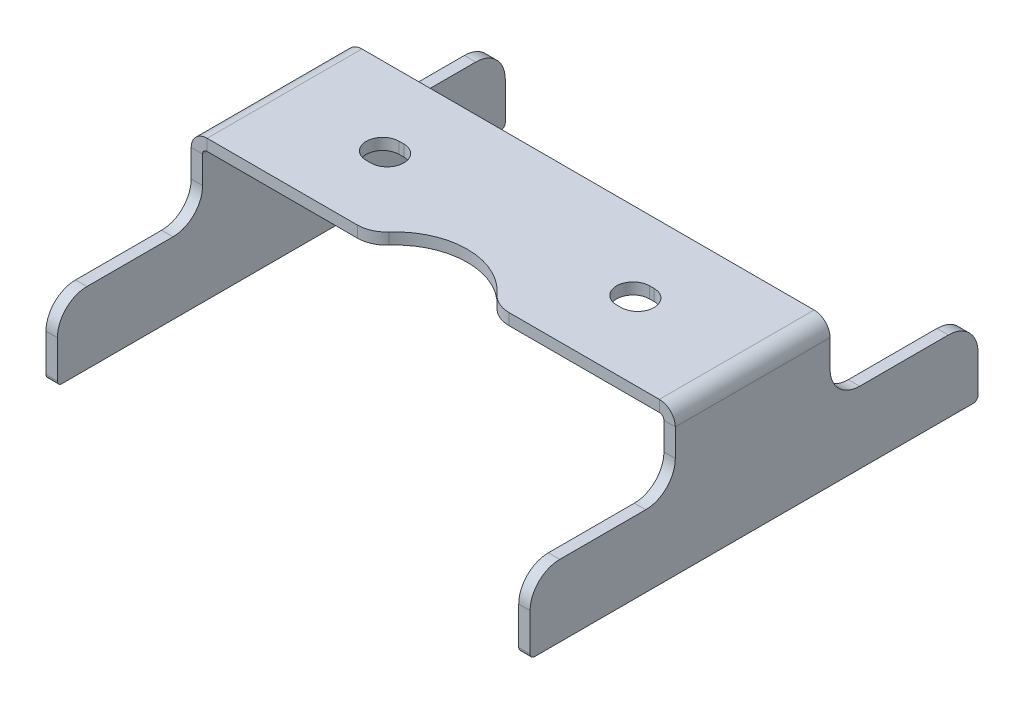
ISO-10303-21;
HEADER;
FILE_DESCRIPTION(('STEP AP214'),'2;1');
FILE_NAME('part.step','',(''),(''),'','','');
FILE_SCHEMA(('AUTOMOTIVE_DESIGN { 1 0 10303 214 1 1 1 1 }'));
ENDSEC;
DATA;
#1=APPLICATION_CONTEXT('core data for automotive mechanical design processes');
#2=APPLICATION_PROTOCOL_DEFINITION('international standard','automotive_design',2000,#1);
#3=PRODUCT_CONTEXT('',#1,'mechanical');
#4=PRODUCT('Part','Part','',(#3));
#5=PRODUCT_RELATED_PRODUCT_CATEGORY('part','',(#4));
#6=PRODUCT_DEFINITION_FORMATION('','',#4);
#7=PRODUCT_DEFINITION_CONTEXT('part definition',#1,'design');
#8=PRODUCT_DEFINITION('design','',#6,#7);
#9=PRODUCT_DEFINITION_SHAPE('','',#8);
#10=(LENGTH_UNIT() NAMED_UNIT(*) SI_UNIT(.MILLI.,.METRE.));
#11=(NAMED_UNIT(*) PLANE_ANGLE_UNIT() SI_UNIT($,.RADIAN.));
#12=(NAMED_UNIT(*) SI_UNIT($,.STERADIAN.) SOLID_ANGLE_UNIT());
#13=UNCERTAINTY_MEASURE_WITH_UNIT(LENGTH_MEASURE(1.E-05),#10,'distance_accuracy_value','');
#14=(GEOMETRIC_REPRESENTATION_CONTEXT(3) GLOBAL_UNCERTAINTY_ASSIGNED_CONTEXT((#13)) GLOBAL_UNIT_ASSIGNED_CONTEXT((#10,
#11,#12)) REPRESENTATION_CONTEXT('',''));
#15=CARTESIAN_POINT('',(0.,0.,0.));
#16=DIRECTION('',(0.,0.,1.));
#17=DIRECTION('',(1.,0.,0.));
#18=AXIS2_PLACEMENT_3D('',#15,#16,#17);
#19=CARTESIAN_POINT('',(151.574822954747,-30.75,-48.2));
#20=DIRECTION('',(-1.,0.,0.));
#21=DIRECTION('',(0.,-1.,0.));
#22=AXIS2_PLACEMENT_3D('',#19,#20,#21);
#23=CYLINDRICAL_SURFACE('',#22,1.);
#24=CARTESIAN_POINT('',(-53.175,-30.75,-48.2));
#25=DIRECTION('',(-1.,0.,0.));
#26=DIRECTION('',(0.,-1.,0.));
#27=AXIS2_PLACEMENT_3D('',#24,#25,#26);
#28=CIRCLE('',#27,1.);
#29=CARTESIAN_POINT('',(-53.175,-30.75,-49.2));
#30=VERTEX_POINT('',#29);
#31=CARTESIAN_POINT('',(-53.175,-31.75,-48.2));
#32=VERTEX_POINT('',#31);
#33=EDGE_CURVE('E116',#30,#32,#28,.T.);
#34=ORIENTED_EDGE('',*,*,#33,.F.);
#35=DIRECTION('',(-1.,0.,0.));
#36=VECTOR('',#35,1.);
#37=CARTESIAN_POINT('',(151.574822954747,-30.75,-49.2));
#38=LINE('',#37,#36);
#39=CARTESIAN_POINT('',(-50.675,-30.75,-49.2));
#40=VERTEX_POINT('',#39);
#41=EDGE_CURVE('E409',#40,#30,#38,.T.);
#42=ORIENTED_EDGE('',*,*,#41,.F.);
#43=CARTESIAN_POINT('',(-50.675,-30.75,-48.2));
#44=DIRECTION('',(-1.,0.,0.));
#45=DIRECTION('',(0.,-1.,0.));
#46=AXIS2_PLACEMENT_3D('',#43,#44,#45);
#47=CIRCLE('',#46,1.);
#48=CARTESIAN_POINT('',(-50.675,-31.75,-48.2));
#49=VERTEX_POINT('',#48);
#50=EDGE_CURVE('E541',#49,#40,#47,.F.);
#51=ORIENTED_EDGE('',*,*,#50,.F.);
#52=DIRECTION('',(-1.,0.,0.));
#53=VECTOR('',#52,1.);
#54=CARTESIAN_POINT('',(151.574822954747,-31.75,-48.2));
#55=LINE('',#54,#53);
#56=EDGE_CURVE('E412',#49,#32,#55,.T.);
#57=ORIENTED_EDGE('',*,*,#56,.T.);
#58=EDGE_LOOP('',(#34,#42,#51,#57));
#59=FACE_BOUND('',#58,.T.);
#60=ADVANCED_FACE('F17',(#59),#23,.T.);
#61=CARTESIAN_POINT('',(151.574822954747,-3.49999999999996,-49.2));
#62=DIRECTION('',(0.,0.,1.));
#63=DIRECTION('',(0.,1.,0.));
#64=AXIS2_PLACEMENT_3D('',#61,#62,#63);
#65=PLANE('',#64);
#66=DIRECTION('',(0.,1.,0.));
#67=VECTOR('',#66,1.);
#68=CARTESIAN_POINT('',(-53.175,-3.5,-49.2));
#69=LINE('',#68,#67);
#70=CARTESIAN_POINT('',(-53.175,-22.5,-49.2));
#71=VERTEX_POINT('',#70);
#72=EDGE_CURVE('E108',#30,#71,#69,.T.);
#73=ORIENTED_EDGE('',*,*,#72,.T.);
#74=DIRECTION('',(-1.,0.,0.));
#75=VECTOR('',#74,1.);
#76=CARTESIAN_POINT('',(151.574822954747,-22.5,-49.2));
#77=LINE('',#76,#75);
#78=CARTESIAN_POINT('',(-50.675,-22.5,-49.2));
#79=VERTEX_POINT('',#78);
#80=EDGE_CURVE('E407',#79,#71,#77,.T.);
#81=ORIENTED_EDGE('',*,*,#80,.F.);
#82=DIRECTION('',(0.,1.,0.));
#83=VECTOR('',#82,1.);
#84=CARTESIAN_POINT('',(-50.675,-3.5,-49.2));
#85=LINE('',#84,#83);
#86=EDGE_CURVE('E539',#40,#79,#85,.T.);
#87=ORIENTED_EDGE('',*,*,#86,.F.);
#88=ORIENTED_EDGE('',*,*,#41,.T.);
#89=EDGE_LOOP('',(#73,#81,#87,#88));
#90=FACE_BOUND('',#89,.T.);
#91=ADVANCED_FACE('F575',(#90),#65,.F.);
#92=CARTESIAN_POINT('',(151.574822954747,-22.5,-42.7));
#93=DIRECTION('',(-1.,0.,0.));
#94=DIRECTION('',(0.,-1.,0.));
#95=AXIS2_PLACEMENT_3D('',#92,#93,#94);
#96=CYLINDRICAL_SURFACE('',#95,6.5);
#97=CARTESIAN_POINT('',(-53.175,-22.5,-42.7));
#98=DIRECTION('',(-1.,0.,0.));
#99=DIRECTION('',(0.,-1.,0.));
#100=AXIS2_PLACEMENT_3D('',#97,#98,#99);
#101=CIRCLE('',#100,6.5);
#102=CARTESIAN_POINT('',(-53.175,-16.,-42.7));
#103=VERTEX_POINT('',#102);
#104=EDGE_CURVE('E551',#103,#71,#101,.T.);
#105=ORIENTED_EDGE('',*,*,#104,.F.);
#106=DIRECTION('',(-1.,0.,0.));
#107=VECTOR('',#106,1.);
#108=CARTESIAN_POINT('',(151.574822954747,-16.,-42.7));
#109=LINE('',#108,#107);
#110=CARTESIAN_POINT('',(-50.675,-16.,-42.7));
#111=VERTEX_POINT('',#110);
#112=EDGE_CURVE('E404',#111,#103,#109,.T.);
#113=ORIENTED_EDGE('',*,*,#112,.F.);
#114=CARTESIAN_POINT('',(-50.675,-22.5,-42.7));
#115=DIRECTION('',(-1.,0.,0.));
#116=DIRECTION('',(0.,-1.,0.));
#117=AXIS2_PLACEMENT_3D('',#114,#115,#116);
#118=CIRCLE('',#117,6.5);
#119=EDGE_CURVE('E537',#79,#111,#118,.F.);
#120=ORIENTED_EDGE('',*,*,#119,.F.);
#121=ORIENTED_EDGE('',*,*,#80,.T.);
#122=EDGE_LOOP('',(#105,#113,#120,#121));
#123=FACE_BOUND('',#122,.T.);
#124=ADVANCED_FACE('F572',(#123),#96,.T.);
#125=CARTESIAN_POINT('',(151.574822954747,-16.,49.2));
#126=DIRECTION('',(0.,-1.,0.));
#127=DIRECTION('',(0.,0.,1.));
#128=AXIS2_PLACEMENT_3D('',#125,#126,#127);
#129=PLANE('',#128);
#130=DIRECTION('',(0.,0.,-1.));
#131=VECTOR('',#130,1.);
#132=CARTESIAN_POINT('',(-53.175,-16.,-49.2));
#133=LINE('',#132,#131);
#134=CARTESIAN_POINT('',(-53.175,-16.,-23.2));
#135=VERTEX_POINT('',#134);
#136=EDGE_CURVE('E554',#135,#103,#133,.T.);
#137=ORIENTED_EDGE('',*,*,#136,.F.);
#138=DIRECTION('',(-1.,0.,0.));
#139=VECTOR('',#138,1.);
#140=CARTESIAN_POINT('',(151.574822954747,-16.,-23.2));
#141=LINE('',#140,#139);
#142=CARTESIAN_POINT('',(-50.675,-16.,-23.2));
#143=VERTEX_POINT('',#142);
#144=EDGE_CURVE('E401',#143,#135,#141,.T.);
#145=ORIENTED_EDGE('',*,*,#144,.F.);
#146=DIRECTION('',(0.,0.,1.));
#147=VECTOR('',#146,1.);
#148=CARTESIAN_POINT('',(-50.675,-16.,49.2));
#149=LINE('',#148,#147);
#150=EDGE_CURVE('E535',#111,#143,#149,.T.);
#151=ORIENTED_EDGE('',*,*,#150,.F.);
#152=ORIENTED_EDGE('',*,*,#112,.T.);
#153=EDGE_LOOP('',(#137,#145,#151,#152));
#154=FACE_BOUND('',#153,.T.);
#155=ADVANCED_FACE('F569',(#154),#129,.F.);
#156=CARTESIAN_POINT('',(151.574822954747,-9.5,-23.2));
#157=DIRECTION('',(-1.,0.,0.));
#158=DIRECTION('',(0.,-1.,0.));
#159=AXIS2_PLACEMENT_3D('',#156,#157,#158);
#160=CYLINDRICAL_SURFACE('',#159,6.5);
#161=CARTESIAN_POINT('',(-53.175,-9.5,-23.2));
#162=DIRECTION('',(-1.,0.,0.));
#163=DIRECTION('',(0.,-1.,0.));
#164=AXIS2_PLACEMENT_3D('',#161,#162,#163);
#165=CIRCLE('',#164,6.5);
#166=CARTESIAN_POINT('',(-53.175,-9.5,-16.7));
#167=VERTEX_POINT('',#166);
#168=EDGE_CURVE('E557',#167,#135,#165,.F.);
#169=ORIENTED_EDGE('',*,*,#168,.F.);
#170=DIRECTION('',(-1.,0.,0.));
#171=VECTOR('',#170,1.);
#172=CARTESIAN_POINT('',(151.574822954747,-9.5,-16.7));
#173=LINE('',#172,#171);
#174=CARTESIAN_POINT('',(-50.675,-9.5,-16.7));
#175=VERTEX_POINT('',#174);
#176=EDGE_CURVE('E547',#175,#167,#173,.T.);
#177=ORIENTED_EDGE('',*,*,#176,.F.);
#178=CARTESIAN_POINT('',(-50.675,-9.5,-23.2));
#179=DIRECTION('',(-1.,0.,0.));
#180=DIRECTION('',(0.,-1.,0.));
#181=AXIS2_PLACEMENT_3D('',#178,#179,#180);
#182=CIRCLE('',#181,6.5);
#183=EDGE_CURVE('E533',#143,#175,#182,.T.);
#184=ORIENTED_EDGE('',*,*,#183,.F.);
#185=ORIENTED_EDGE('',*,*,#144,.T.);
#186=EDGE_LOOP('',(#169,#177,#184,#185));
#187=FACE_BOUND('',#186,.T.);
#188=ADVANCED_FACE('F565',(#187),#160,.F.);
#189=CARTESIAN_POINT('',(151.574822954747,-16.,49.2));
#190=DIRECTION('',(0.,-1.,0.));
#191=DIRECTION('',(1.,0.,0.));
#192=AXIS2_PLACEMENT_3D('',#189,#190,#191);
#193=PLANE('',#192);
#194=DIRECTION('',(0.,0.,-1.));
#195=VECTOR('',#194,1.);
#196=CARTESIAN_POINT('',(-53.175,-16.,49.2));
#197=LINE('',#196,#195);
#198=CARTESIAN_POINT('',(-53.175,-16.,42.7));
#199=VERTEX_POINT('',#198);
#200=CARTESIAN_POINT('',(-53.175,-16.,23.8));
#201=VERTEX_POINT('',#200);
#202=EDGE_CURVE('E369',#199,#201,#197,.T.);
#203=ORIENTED_EDGE('',*,*,#202,.F.);
#204=DIRECTION('',(-1.,0.,0.));
#205=VECTOR('',#204,1.);
#206=CARTESIAN_POINT('',(151.574822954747,-16.,42.7));
#207=LINE('',#206,#205);
#208=CARTESIAN_POINT('',(-50.675,-16.,42.7));
#209=VERTEX_POINT('',#208);
#210=EDGE_CURVE('E396',#209,#199,#207,.T.);
#211=ORIENTED_EDGE('',*,*,#210,.F.);
#212=DIRECTION('',(0.,0.,1.));
#213=VECTOR('',#212,1.);
#214=CARTESIAN_POINT('',(-50.675,-16.,49.2));
#215=LINE('',#214,#213);
#216=CARTESIAN_POINT('',(-50.675,-16.,23.8));
#217=VERTEX_POINT('',#216);
#218=EDGE_CURVE('E27',#217,#209,#215,.T.);
#219=ORIENTED_EDGE('',*,*,#218,.F.);
#220=DIRECTION('',(-1.,0.,0.));
#221=VECTOR('',#220,1.);
#222=CARTESIAN_POINT('',(151.574822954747,-16.,23.8));
#223=LINE('',#222,#221);
#224=EDGE_CURVE('E398',#217,#201,#223,.T.);
#225=ORIENTED_EDGE('',*,*,#224,.T.);
#226=EDGE_LOOP('',(#203,#211,#219,#225));
#227=FACE_BOUND('',#226,.T.);
#228=ADVANCED_FACE('F594',(#227),#193,.F.);
#229=CARTESIAN_POINT('',(151.574822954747,-22.5,42.7));
#230=DIRECTION('',(-1.,0.,0.));
#231=DIRECTION('',(0.,-1.,0.));
#232=AXIS2_PLACEMENT_3D('',#229,#230,#231);
#233=CYLINDRICAL_SURFACE('',#232,6.5);
#234=CARTESIAN_POINT('',(-53.175,-22.5,42.7));
#235=DIRECTION('',(-1.,0.,0.));
#236=DIRECTION('',(0.,-1.,0.));
#237=AXIS2_PLACEMENT_3D('',#234,#235,#236);
#238=CIRCLE('',#237,6.5);
#239=CARTESIAN_POINT('',(-53.175,-22.5,49.2));
#240=VERTEX_POINT('',#239);
#241=EDGE_CURVE('E374',#240,#199,#238,.T.);
#242=ORIENTED_EDGE('',*,*,#241,.F.);
#243=DIRECTION('',(-1.,0.,0.));
#244=VECTOR('',#243,1.);
#245=CARTESIAN_POINT('',(151.574822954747,-22.5,49.2));
#246=LINE('',#245,#244);
#247=CARTESIAN_POINT('',(-50.675,-22.5,49.2));
#248=VERTEX_POINT('',#247);
#249=EDGE_CURVE('E393',#248,#240,#246,.T.);
#250=ORIENTED_EDGE('',*,*,#249,.F.);
#251=CARTESIAN_POINT('',(-50.675,-22.5,42.7));
#252=DIRECTION('',(-1.,0.,0.));
#253=DIRECTION('',(0.,-1.,0.));
#254=AXIS2_PLACEMENT_3D('',#251,#252,#253);
#255=CIRCLE('',#254,6.5);
#256=EDGE_CURVE('E11',#209,#248,#255,.F.);
#257=ORIENTED_EDGE('',*,*,#256,.F.);
#258=ORIENTED_EDGE('',*,*,#210,.T.);
#259=EDGE_LOOP('',(#242,#250,#257,#258));
#260=FACE_BOUND('',#259,.T.);
#261=ADVANCED_FACE('F590',(#260),#233,.T.);
#262=CARTESIAN_POINT('',(151.574822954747,-3.49999999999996,49.2));
#263=DIRECTION('',(0.,0.,1.));
#264=DIRECTION('',(0.,1.,0.));
#265=AXIS2_PLACEMENT_3D('',#262,#263,#264);
#266=PLANE('',#265);
#267=ORIENTED_EDGE('',*,*,#249,.T.);
#268=DIRECTION('',(0.,1.,0.));
#269=VECTOR('',#268,1.);
#270=CARTESIAN_POINT('',(-53.175,-3.5,49.2));
#271=LINE('',#270,#269);
#272=CARTESIAN_POINT('',(-53.175,-30.75,49.2));
#273=VERTEX_POINT('',#272);
#274=EDGE_CURVE('E377',#273,#240,#271,.T.);
#275=ORIENTED_EDGE('',*,*,#274,.F.);
#276=DIRECTION('',(-1.,0.,0.));
#277=VECTOR('',#276,1.);
#278=CARTESIAN_POINT('',(151.574822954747,-30.75,49.2));
#279=LINE('',#278,#277);
#280=CARTESIAN_POINT('',(-50.675,-30.75,49.2));
#281=VERTEX_POINT('',#280);
#282=EDGE_CURVE('E388',#281,#273,#279,.T.);
#283=ORIENTED_EDGE('',*,*,#282,.F.);
#284=DIRECTION('',(0.,1.,0.));
#285=VECTOR('',#284,1.);
#286=CARTESIAN_POINT('',(-50.675,-3.5,49.2));
#287=LINE('',#286,#285);
#288=EDGE_CURVE('E391',#281,#248,#287,.T.);
#289=ORIENTED_EDGE('',*,*,#288,.T.);
#290=EDGE_LOOP('',(#267,#275,#283,#289));
#291=FACE_BOUND('',#290,.T.);
#292=ADVANCED_FACE('F587',(#291),#266,.T.);
#293=CARTESIAN_POINT('',(151.574822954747,-30.75,48.2));
#294=DIRECTION('',(-1.,0.,0.));
#295=DIRECTION('',(0.,-1.,0.));
#296=AXIS2_PLACEMENT_3D('',#293,#294,#295);
#297=CYLINDRICAL_SURFACE('',#296,1.);
#298=CARTESIAN_POINT('',(-53.175,-30.75,48.2));
#299=DIRECTION('',(-1.,0.,0.));
#300=DIRECTION('',(0.,-1.,0.));
#301=AXIS2_PLACEMENT_3D('',#298,#299,#300);
#302=CIRCLE('',#301,1.);
#303=CARTESIAN_POINT('',(-53.175,-31.75,48.2));
#304=VERTEX_POINT('',#303);
#305=EDGE_CURVE('E360',#304,#273,#302,.T.);
#306=ORIENTED_EDGE('',*,*,#305,.F.);
#307=DIRECTION('',(-1.,0.,0.));
#308=VECTOR('',#307,1.);
#309=CARTESIAN_POINT('',(151.574822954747,-31.75,48.2));
#310=LINE('',#309,#308);
#311=CARTESIAN_POINT('',(-50.675,-31.75,48.2));
#312=VERTEX_POINT('',#311);
#313=EDGE_CURVE('E383',#312,#304,#310,.T.);
#314=ORIENTED_EDGE('',*,*,#313,.F.);
#315=CARTESIAN_POINT('',(-50.675,-30.75,48.2));
#316=DIRECTION('',(-1.,0.,0.));
#317=DIRECTION('',(0.,-1.,0.));
#318=AXIS2_PLACEMENT_3D('',#315,#316,#317);
#319=CIRCLE('',#318,1.);
#320=EDGE_CURVE('E545',#281,#312,#319,.F.);
#321=ORIENTED_EDGE('',*,*,#320,.F.);
#322=ORIENTED_EDGE('',*,*,#282,.T.);
#323=EDGE_LOOP('',(#306,#314,#321,#322));
#324=FACE_BOUND('',#323,.T.);
#325=ADVANCED_FACE('F583',(#324),#297,.T.);
#326=CARTESIAN_POINT('',(151.574822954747,-31.75,49.2));
#327=DIRECTION('',(0.,1.,0.));
#328=DIRECTION('',(-1.,0.,0.));
#329=AXIS2_PLACEMENT_3D('',#326,#327,#328);
#330=PLANE('',#329);
#331=DIRECTION('',(0.,0.,-1.));
#332=VECTOR('',#331,1.);
#333=CARTESIAN_POINT('',(-53.175,-31.75,49.2));
#334=LINE('',#333,#332);
#335=EDGE_CURVE('E386',#304,#32,#334,.T.);
#336=ORIENTED_EDGE('',*,*,#335,.T.);
#337=ORIENTED_EDGE('',*,*,#56,.F.);
#338=DIRECTION('',(0.,0.,-1.));
#339=VECTOR('',#338,1.);
#340=CARTESIAN_POINT('',(-50.675,-31.75,49.2));
#341=LINE('',#340,#339);
#342=EDGE_CURVE('E543',#312,#49,#341,.T.);
#343=ORIENTED_EDGE('',*,*,#342,.F.);
#344=ORIENTED_EDGE('',*,*,#313,.T.);
#345=EDGE_LOOP('',(#336,#337,#343,#344));
#346=FACE_BOUND('',#345,.T.);
#347=ADVANCED_FACE('F580',(#346),#330,.F.);
#348=CARTESIAN_POINT('',(151.574822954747,-9.5,23.8));
#349=DIRECTION('',(-1.,0.,0.));
#350=DIRECTION('',(0.,-1.,0.));
#351=AXIS2_PLACEMENT_3D('',#348,#349,#350);
#352=CYLINDRICAL_SURFACE('',#351,6.5);
#353=CARTESIAN_POINT('',(-53.175,-9.5,23.8));
#354=DIRECTION('',(-1.,0.,0.));
#355=DIRECTION('',(0.,-1.,0.));
#356=AXIS2_PLACEMENT_3D('',#353,#354,#355);
#357=CIRCLE('',#356,6.5);
#358=CARTESIAN_POINT('',(-53.175,-9.5,17.3));
#359=VERTEX_POINT('',#358);
#360=EDGE_CURVE('E367',#201,#359,#357,.F.);
#361=ORIENTED_EDGE('',*,*,#360,.F.);
#362=ORIENTED_EDGE('',*,*,#224,.F.);
#363=CARTESIAN_POINT('',(-50.675,-9.5,23.8));
#364=DIRECTION('',(-1.,0.,0.));
#365=DIRECTION('',(0.,-1.,0.));
#366=AXIS2_PLACEMENT_3D('',#363,#364,#365);
#367=CIRCLE('',#366,6.5);
#368=CARTESIAN_POINT('',(-50.675,-9.5,17.3));
#369=VERTEX_POINT('',#368);
#370=EDGE_CURVE('E527',#369,#217,#367,.T.);
#371=ORIENTED_EDGE('',*,*,#370,.F.);
#372=DIRECTION('',(-1.,0.,0.));
#373=VECTOR('',#372,1.);
#374=CARTESIAN_POINT('',(151.574822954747,-9.5,17.3));
#375=LINE('',#374,#373);
#376=EDGE_CURVE('E361',#369,#359,#375,.T.);
#377=ORIENTED_EDGE('',*,*,#376,.T.);
#378=EDGE_LOOP('',(#361,#362,#371,#377));
#379=FACE_BOUND('',#378,.T.);
#380=ADVANCED_FACE('F599',(#379),#352,.F.);
#381=CARTESIAN_POINT('',(151.574822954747,-3.49999999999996,17.3));
#382=DIRECTION('',(0.,0.,-1.));
#383=DIRECTION('',(0.,-1.,0.));
#384=AXIS2_PLACEMENT_3D('',#381,#382,#383);
#385=PLANE('',#384);
#386=DIRECTION('',(0.,1.,0.));
#387=VECTOR('',#386,1.);
#388=CARTESIAN_POINT('',(-53.175,-16.,17.3));
#389=LINE('',#388,#387);
#390=CARTESIAN_POINT('',(-53.175,-3.5,17.3));
#391=VERTEX_POINT('',#390);
#392=EDGE_CURVE('E343',#359,#391,#389,.T.);
#393=ORIENTED_EDGE('',*,*,#392,.F.);
#394=ORIENTED_EDGE('',*,*,#376,.F.);
#395=DIRECTION('',(0.,-1.,0.));
#396=VECTOR('',#395,1.);
#397=CARTESIAN_POINT('',(-50.675,-3.5,17.3));
#398=LINE('',#397,#396);
#399=CARTESIAN_POINT('',(-50.675,-3.5,17.3));
#400=VERTEX_POINT('',#399);
#401=EDGE_CURVE('E359',#400,#369,#398,.T.);
#402=ORIENTED_EDGE('',*,*,#401,.F.);
#403=DIRECTION('',(-1.,0.,0.));
#404=VECTOR('',#403,1.);
#405=CARTESIAN_POINT('',(151.574822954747,-3.49999999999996,17.3));
#406=LINE('',#405,#404);
#407=EDGE_CURVE('E348',#400,#391,#406,.T.);
#408=ORIENTED_EDGE('',*,*,#407,.T.);
#409=EDGE_LOOP('',(#393,#394,#402,#408));
#410=FACE_BOUND('',#409,.T.);
#411=ADVANCED_FACE('F356',(#410),#385,.F.);
#412=CARTESIAN_POINT('',(-53.175,-3.5,49.2));
#413=DIRECTION('',(-1.,0.,0.));
#414=DIRECTION('',(0.,-1.,0.));
#415=AXIS2_PLACEMENT_3D('',#412,#413,#414);
#416=PLANE('',#415);
#417=ORIENTED_EDGE('',*,*,#335,.F.);
#418=ORIENTED_EDGE('',*,*,#305,.T.);
#419=ORIENTED_EDGE('',*,*,#274,.T.);
#420=ORIENTED_EDGE('',*,*,#241,.T.);
#421=ORIENTED_EDGE('',*,*,#202,.T.);
#422=ORIENTED_EDGE('',*,*,#360,.T.);
#423=ORIENTED_EDGE('',*,*,#392,.T.);
#424=DIRECTION('',(0.,0.,-1.));
#425=VECTOR('',#424,1.);
#426=CARTESIAN_POINT('',(-53.175,-3.5,49.2));
#427=LINE('',#426,#425);
#428=CARTESIAN_POINT('',(-53.175,-3.5,-16.7));
#429=VERTEX_POINT('',#428);
#430=EDGE_CURVE('E331',#391,#429,#427,.T.);
#431=ORIENTED_EDGE('',*,*,#430,.T.);
#432=DIRECTION('',(0.,-1.,0.));
#433=VECTOR('',#432,1.);
#434=CARTESIAN_POINT('',(-53.175,-16.,-16.7));
#435=LINE('',#434,#433);
#436=EDGE_CURVE('E342',#429,#167,#435,.T.);
#437=ORIENTED_EDGE('',*,*,#436,.T.);
#438=ORIENTED_EDGE('',*,*,#168,.T.);
#439=ORIENTED_EDGE('',*,*,#136,.T.);
#440=ORIENTED_EDGE('',*,*,#104,.T.);
#441=ORIENTED_EDGE('',*,*,#72,.F.);
#442=ORIENTED_EDGE('',*,*,#33,.T.);
#443=EDGE_LOOP('',(#417,#418,#419,#420,#421,#422,#423,#431,#437,#438,#439,#440,#441,#442));
#444=FACE_BOUND('',#443,.T.);
#445=ADVANCED_FACE('F365',(#444),#416,.T.);
#446=CARTESIAN_POINT('',(151.574822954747,-3.49999999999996,-16.7));
#447=DIRECTION('',(0.,0.,1.));
#448=DIRECTION('',(0.,1.,0.));
#449=AXIS2_PLACEMENT_3D('',#446,#447,#448);
#450=PLANE('',#449);
#451=ORIENTED_EDGE('',*,*,#436,.F.);
#452=DIRECTION('',(-1.,0.,0.));
#453=VECTOR('',#452,1.);
#454=CARTESIAN_POINT('',(151.574822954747,-3.49999999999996,-16.7));
#455=LINE('',#454,#453);
#456=CARTESIAN_POINT('',(-50.675,-3.5,-16.7));
#457=VERTEX_POINT('',#456);
#458=EDGE_CURVE('E413',#457,#429,#455,.T.);
#459=ORIENTED_EDGE('',*,*,#458,.F.);
#460=DIRECTION('',(0.,1.,0.));
#461=VECTOR('',#460,1.);
#462=CARTESIAN_POINT('',(-50.675,-3.5,-16.7));
#463=LINE('',#462,#461);
#464=EDGE_CURVE('E530',#175,#457,#463,.T.);
#465=ORIENTED_EDGE('',*,*,#464,.F.);
#466=ORIENTED_EDGE('',*,*,#176,.T.);
#467=EDGE_LOOP('',(#451,#459,#465,#466));
#468=FACE_BOUND('',#467,.T.);
#469=ADVANCED_FACE('F560',(#468),#450,.F.);
#470=CARTESIAN_POINT('',(-50.675,-3.5,49.2));
#471=DIRECTION('',(-1.,0.,0.));
#472=DIRECTION('',(0.,-1.,0.));
#473=AXIS2_PLACEMENT_3D('',#470,#471,#472);
#474=PLANE('',#473);
#475=ORIENTED_EDGE('',*,*,#288,.F.);
#476=ORIENTED_EDGE('',*,*,#320,.T.);
#477=ORIENTED_EDGE('',*,*,#342,.T.);
#478=ORIENTED_EDGE('',*,*,#50,.T.);
#479=ORIENTED_EDGE('',*,*,#86,.T.);
#480=ORIENTED_EDGE('',*,*,#119,.T.);
#481=ORIENTED_EDGE('',*,*,#150,.T.);
#482=ORIENTED_EDGE('',*,*,#183,.T.);
#483=ORIENTED_EDGE('',*,*,#464,.T.);
#484=DIRECTION('',(0.,0.,-1.));
#485=VECTOR('',#484,1.);
#486=CARTESIAN_POINT('',(-50.675,-3.5,49.2));
#487=LINE('',#486,#485);
#488=EDGE_CURVE('E21',#400,#457,#487,.T.);
#489=ORIENTED_EDGE('',*,*,#488,.F.);
#490=ORIENTED_EDGE('',*,*,#401,.T.);
#491=ORIENTED_EDGE('',*,*,#370,.T.);
#492=ORIENTED_EDGE('',*,*,#218,.T.);
#493=ORIENTED_EDGE('',*,*,#256,.T.);
#494=EDGE_LOOP('',(#475,#476,#477,#478,#479,#480,#481,#482,#483,#489,#490,#491,#492,#493));
#495=FACE_BOUND('',#494,.T.);
#496=ADVANCED_FACE('F19',(#495),#474,.F.);
#497=CARTESIAN_POINT('',(-151.574822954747,-30.75,48.2));
#498=DIRECTION('',(1.,0.,0.));
#499=DIRECTION('',(0.,1.,0.));
#500=AXIS2_PLACEMENT_3D('',#497,#498,#499);
#501=CYLINDRICAL_SURFACE('',#500,1.);
#502=CARTESIAN_POINT('',(53.175,-30.75,48.2));
#503=DIRECTION('',(1.,0.,0.));
#504=DIRECTION('',(0.,1.,0.));
#505=AXIS2_PLACEMENT_3D('',#502,#503,#504);
#506=CIRCLE('',#505,1.);
#507=CARTESIAN_POINT('',(53.175,-30.75,49.2));
#508=VERTEX_POINT('',#507);
#509=CARTESIAN_POINT('',(53.175,-31.75,48.2));
#510=VERTEX_POINT('',#509);
#511=EDGE_CURVE('E211',#508,#510,#506,.T.);
#512=ORIENTED_EDGE('',*,*,#511,.F.);
#513=DIRECTION('',(1.,0.,0.));
#514=VECTOR('',#513,1.);
#515=CARTESIAN_POINT('',(-151.574822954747,-30.75,49.2));
#516=LINE('',#515,#514);
#517=CARTESIAN_POINT('',(50.675,-30.75,49.2));
#518=VERTEX_POINT('',#517);
#519=EDGE_CURVE('E516',#518,#508,#516,.T.);
#520=ORIENTED_EDGE('',*,*,#519,.F.);
#521=CARTESIAN_POINT('',(50.675,-30.75,48.2));
#522=DIRECTION('',(1.,0.,0.));
#523=DIRECTION('',(0.,1.,0.));
#524=AXIS2_PLACEMENT_3D('',#521,#522,#523);
#525=CIRCLE('',#524,1.);
#526=CARTESIAN_POINT('',(50.675,-31.75,48.2));
#527=VERTEX_POINT('',#526);
#528=EDGE_CURVE('E441',#527,#518,#525,.F.);
#529=ORIENTED_EDGE('',*,*,#528,.F.);
#530=DIRECTION('',(1.,0.,0.));
#531=VECTOR('',#530,1.);
#532=CARTESIAN_POINT('',(-151.574822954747,-31.75,48.2));
#533=LINE('',#532,#531);
#534=EDGE_CURVE('E518',#527,#510,#533,.T.);
#535=ORIENTED_EDGE('',*,*,#534,.T.);
#536=EDGE_LOOP('',(#512,#520,#529,#535));
#537=FACE_BOUND('',#536,.T.);
#538=ADVANCED_FACE('F601',(#537),#501,.T.);
#539=CARTESIAN_POINT('',(-151.574822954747,-3.5,49.2));
#540=DIRECTION('',(0.,0.,1.));
#541=DIRECTION('',(0.,-1.,0.));
#542=AXIS2_PLACEMENT_3D('',#539,#540,#541);
#543=PLANE('',#542);
#544=ORIENTED_EDGE('',*,*,#519,.T.);
#545=DIRECTION('',(0.,-1.,0.));
#546=VECTOR('',#545,1.);
#547=CARTESIAN_POINT('',(53.175,-3.5,49.2));
#548=LINE('',#547,#546);
#549=CARTESIAN_POINT('',(53.175,-22.5,49.2));
#550=VERTEX_POINT('',#549);
#551=EDGE_CURVE('E204',#550,#508,#548,.T.);
#552=ORIENTED_EDGE('',*,*,#551,.F.);
#553=DIRECTION('',(1.,0.,0.));
#554=VECTOR('',#553,1.);
#555=CARTESIAN_POINT('',(-151.574822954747,-22.5,49.2));
#556=LINE('',#555,#554);
#557=CARTESIAN_POINT('',(50.675,-22.5,49.2));
#558=VERTEX_POINT('',#557);
#559=EDGE_CURVE('E511',#558,#550,#556,.T.);
#560=ORIENTED_EDGE('',*,*,#559,.F.);
#561=DIRECTION('',(0.,-1.,0.));
#562=VECTOR('',#561,1.);
#563=CARTESIAN_POINT('',(50.675,-3.5,49.2));
#564=LINE('',#563,#562);
#565=EDGE_CURVE('E513',#558,#518,#564,.T.);
#566=ORIENTED_EDGE('',*,*,#565,.T.);
#567=EDGE_LOOP('',(#544,#552,#560,#566));
#568=FACE_BOUND('',#567,.T.);
#569=ADVANCED_FACE('F608',(#568),#543,.T.);
#570=CARTESIAN_POINT('',(-151.574822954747,-22.5,42.7));
#571=DIRECTION('',(1.,0.,0.));
#572=DIRECTION('',(0.,1.,0.));
#573=AXIS2_PLACEMENT_3D('',#570,#571,#572);
#574=CYLINDRICAL_SURFACE('',#573,6.5);
#575=CARTESIAN_POINT('',(53.175,-22.5,42.7));
#576=DIRECTION('',(1.,0.,0.));
#577=DIRECTION('',(0.,1.,0.));
#578=AXIS2_PLACEMENT_3D('',#575,#576,#577);
#579=CIRCLE('',#578,6.5);
#580=CARTESIAN_POINT('',(53.175,-16.,42.7));
#581=VERTEX_POINT('',#580);
#582=EDGE_CURVE('E455',#581,#550,#579,.T.);
#583=ORIENTED_EDGE('',*,*,#582,.F.);
#584=DIRECTION('',(1.,0.,0.));
#585=VECTOR('',#584,1.);
#586=CARTESIAN_POINT('',(-151.574822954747,-16.,42.7));
#587=LINE('',#586,#585);
#588=CARTESIAN_POINT('',(50.675,-16.,42.7));
#589=VERTEX_POINT('',#588);
#590=EDGE_CURVE('E506',#589,#581,#587,.T.);
#591=ORIENTED_EDGE('',*,*,#590,.F.);
#592=CARTESIAN_POINT('',(50.675,-22.5,42.7));
#593=DIRECTION('',(1.,0.,0.));
#594=DIRECTION('',(0.,1.,0.));
#595=AXIS2_PLACEMENT_3D('',#592,#593,#594);
#596=CIRCLE('',#595,6.5);
#597=EDGE_CURVE('E439',#558,#589,#596,.F.);
#598=ORIENTED_EDGE('',*,*,#597,.F.);
#599=ORIENTED_EDGE('',*,*,#559,.T.);
#600=EDGE_LOOP('',(#583,#591,#598,#599));
#601=FACE_BOUND('',#600,.T.);
#602=ADVANCED_FACE('F710',(#601),#574,.T.);
#603=CARTESIAN_POINT('',(-151.574822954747,-16.,49.2));
#604=DIRECTION('',(0.,-1.,0.));
#605=DIRECTION('',(1.,0.,0.));
#606=AXIS2_PLACEMENT_3D('',#603,#604,#605);
#607=PLANE('',#606);
#608=DIRECTION('',(0.,0.,-1.));
#609=VECTOR('',#608,1.);
#610=CARTESIAN_POINT('',(53.175,-16.,49.2));
#611=LINE('',#610,#609);
#612=CARTESIAN_POINT('',(53.175,-16.,23.8));
#613=VERTEX_POINT('',#612);
#614=EDGE_CURVE('E509',#581,#613,#611,.T.);
#615=ORIENTED_EDGE('',*,*,#614,.T.);
#616=DIRECTION('',(1.,0.,0.));
#617=VECTOR('',#616,1.);
#618=CARTESIAN_POINT('',(-151.574822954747,-16.,23.8));
#619=LINE('',#618,#617);
#620=CARTESIAN_POINT('',(50.675,-16.,23.8));
#621=VERTEX_POINT('',#620);
#622=EDGE_CURVE('E503',#621,#613,#619,.T.);
#623=ORIENTED_EDGE('',*,*,#622,.F.);
#624=DIRECTION('',(0.,0.,-1.));
#625=VECTOR('',#624,1.);
#626=CARTESIAN_POINT('',(50.675,-16.,49.2));
#627=LINE('',#626,#625);
#628=EDGE_CURVE('E437',#589,#621,#627,.T.);
#629=ORIENTED_EDGE('',*,*,#628,.F.);
#630=ORIENTED_EDGE('',*,*,#590,.T.);
#631=EDGE_LOOP('',(#615,#623,#629,#630));
#632=FACE_BOUND('',#631,.T.);
#633=ADVANCED_FACE('F717',(#632),#607,.F.);
#634=CARTESIAN_POINT('',(-151.574822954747,-9.5,23.8));
#635=DIRECTION('',(1.,0.,0.));
#636=DIRECTION('',(0.,1.,0.));
#637=AXIS2_PLACEMENT_3D('',#634,#635,#636);
#638=CYLINDRICAL_SURFACE('',#637,6.5);
#639=CARTESIAN_POINT('',(53.175,-9.5,23.8));
#640=DIRECTION('',(1.,0.,0.));
#641=DIRECTION('',(0.,1.,0.));
#642=AXIS2_PLACEMENT_3D('',#639,#640,#641);
#643=CIRCLE('',#642,6.5);
#644=CARTESIAN_POINT('',(53.175,-9.5,17.3));
#645=VERTEX_POINT('',#644);
#646=EDGE_CURVE('E458',#645,#613,#643,.F.);
#647=ORIENTED_EDGE('',*,*,#646,.F.);
#648=DIRECTION('',(1.,0.,0.));
#649=VECTOR('',#648,1.);
#650=CARTESIAN_POINT('',(-151.574822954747,-9.5,17.3));
#651=LINE('',#650,#649);
#652=CARTESIAN_POINT('',(50.675,-9.5,17.3));
#653=VERTEX_POINT('',#652);
#654=EDGE_CURVE('E447',#653,#645,#651,.T.);
#655=ORIENTED_EDGE('',*,*,#654,.F.);
#656=CARTESIAN_POINT('',(50.675,-9.5,23.8));
#657=DIRECTION('',(1.,0.,0.));
#658=DIRECTION('',(0.,1.,0.));
#659=AXIS2_PLACEMENT_3D('',#656,#657,#658);
#660=CIRCLE('',#659,6.5);
#661=EDGE_CURVE('E435',#621,#653,#660,.T.);
#662=ORIENTED_EDGE('',*,*,#661,.F.);
#663=ORIENTED_EDGE('',*,*,#622,.T.);
#664=EDGE_LOOP('',(#647,#655,#662,#663));
#665=FACE_BOUND('',#664,.T.);
#666=ADVANCED_FACE('F725',(#665),#638,.F.);
#667=CARTESIAN_POINT('',(-151.574822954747,-16.,49.2));
#668=DIRECTION('',(0.,-1.,0.));
#669=DIRECTION('',(0.,0.,-1.));
#670=AXIS2_PLACEMENT_3D('',#667,#668,#669);
#671=PLANE('',#670);
#672=DIRECTION('',(0.,0.,-1.));
#673=VECTOR('',#672,1.);
#674=CARTESIAN_POINT('',(53.175,-16.,-49.2));
#675=LINE('',#674,#673);
#676=CARTESIAN_POINT('',(53.175,-16.,-23.2));
#677=VERTEX_POINT('',#676);
#678=CARTESIAN_POINT('',(53.175,-16.,-42.7));
#679=VERTEX_POINT('',#678);
#680=EDGE_CURVE('E500',#677,#679,#675,.T.);
#681=ORIENTED_EDGE('',*,*,#680,.T.);
#682=DIRECTION('',(1.,0.,0.));
#683=VECTOR('',#682,1.);
#684=CARTESIAN_POINT('',(-151.574822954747,-16.,-42.7));
#685=LINE('',#684,#683);
#686=CARTESIAN_POINT('',(50.675,-16.,-42.7));
#687=VERTEX_POINT('',#686);
#688=EDGE_CURVE('E495',#687,#679,#685,.T.);
#689=ORIENTED_EDGE('',*,*,#688,.F.);
#690=DIRECTION('',(0.,0.,-1.));
#691=VECTOR('',#690,1.);
#692=CARTESIAN_POINT('',(50.675,-16.,49.2));
#693=LINE('',#692,#691);
#694=CARTESIAN_POINT('',(50.675,-16.,-23.2));
#695=VERTEX_POINT('',#694);
#696=EDGE_CURVE('E420',#695,#687,#693,.T.);
#697=ORIENTED_EDGE('',*,*,#696,.F.);
#698=DIRECTION('',(1.,0.,0.));
#699=VECTOR('',#698,1.);
#700=CARTESIAN_POINT('',(-151.574822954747,-16.,-23.2));
#701=LINE('',#700,#699);
#702=EDGE_CURVE('E497',#695,#677,#701,.T.);
#703=ORIENTED_EDGE('',*,*,#702,.T.);
#704=EDGE_LOOP('',(#681,#689,#697,#703));
#705=FACE_BOUND('',#704,.T.);
#706=ADVANCED_FACE('F733',(#705),#671,.F.);
#707=CARTESIAN_POINT('',(-151.574822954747,-22.5,-42.7));
#708=DIRECTION('',(1.,0.,0.));
#709=DIRECTION('',(0.,1.,0.));
#710=AXIS2_PLACEMENT_3D('',#707,#708,#709);
#711=CYLINDRICAL_SURFACE('',#710,6.5);
#712=CARTESIAN_POINT('',(53.175,-22.5,-42.7));
#713=DIRECTION('',(1.,0.,0.));
#714=DIRECTION('',(0.,1.,0.));
#715=AXIS2_PLACEMENT_3D('',#712,#713,#714);
#716=CIRCLE('',#715,6.5);
#717=CARTESIAN_POINT('',(53.175,-22.5,-49.2));
#718=VERTEX_POINT('',#717);
#719=EDGE_CURVE('E464',#718,#679,#716,.T.);
#720=ORIENTED_EDGE('',*,*,#719,.F.);
#721=DIRECTION('',(1.,0.,0.));
#722=VECTOR('',#721,1.);
#723=CARTESIAN_POINT('',(-151.574822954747,-22.5,-49.2));
#724=LINE('',#723,#722);
#725=CARTESIAN_POINT('',(50.675,-22.5,-49.2));
#726=VERTEX_POINT('',#725);
#727=EDGE_CURVE('E490',#726,#718,#724,.T.);
#728=ORIENTED_EDGE('',*,*,#727,.F.);
#729=CARTESIAN_POINT('',(50.675,-22.5,-42.7));
#730=DIRECTION('',(1.,0.,0.));
#731=DIRECTION('',(0.,1.,0.));
#732=AXIS2_PLACEMENT_3D('',#729,#730,#731);
#733=CIRCLE('',#732,6.5);
#734=EDGE_CURVE('E124',#687,#726,#733,.F.);
#735=ORIENTED_EDGE('',*,*,#734,.F.);
#736=ORIENTED_EDGE('',*,*,#688,.T.);
#737=EDGE_LOOP('',(#720,#728,#735,#736));
#738=FACE_BOUND('',#737,.T.);
#739=ADVANCED_FACE('F741',(#738),#711,.T.);
#740=CARTESIAN_POINT('',(-151.574822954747,-3.50000000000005,-49.2));
#741=DIRECTION('',(0.,0.,1.));
#742=DIRECTION('',(0.,-1.,0.));
#743=AXIS2_PLACEMENT_3D('',#740,#741,#742);
#744=PLANE('',#743);
#745=DIRECTION('',(0.,-1.,0.));
#746=VECTOR('',#745,1.);
#747=CARTESIAN_POINT('',(53.175,-3.5,-49.2));
#748=LINE('',#747,#746);
#749=CARTESIAN_POINT('',(53.175,-30.75,-49.2));
#750=VERTEX_POINT('',#749);
#751=EDGE_CURVE('E493',#718,#750,#748,.T.);
#752=ORIENTED_EDGE('',*,*,#751,.T.);
#753=DIRECTION('',(1.,0.,0.));
#754=VECTOR('',#753,1.);
#755=CARTESIAN_POINT('',(-151.574822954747,-30.75,-49.2));
#756=LINE('',#755,#754);
#757=CARTESIAN_POINT('',(50.675,-30.75,-49.2));
#758=VERTEX_POINT('',#757);
#759=EDGE_CURVE('E487',#758,#750,#756,.T.);
#760=ORIENTED_EDGE('',*,*,#759,.F.);
#761=DIRECTION('',(0.,-1.,0.));
#762=VECTOR('',#761,1.);
#763=CARTESIAN_POINT('',(50.675,-3.5,-49.2));
#764=LINE('',#763,#762);
#765=EDGE_CURVE('E445',#726,#758,#764,.T.);
#766=ORIENTED_EDGE('',*,*,#765,.F.);
#767=ORIENTED_EDGE('',*,*,#727,.T.);
#768=EDGE_LOOP('',(#752,#760,#766,#767));
#769=FACE_BOUND('',#768,.T.);
#770=ADVANCED_FACE('F749',(#769),#744,.F.);
#771=CARTESIAN_POINT('',(-151.574822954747,-30.75,-48.2));
#772=DIRECTION('',(1.,0.,0.));
#773=DIRECTION('',(0.,1.,0.));
#774=AXIS2_PLACEMENT_3D('',#771,#772,#773);
#775=CYLINDRICAL_SURFACE('',#774,1.);
#776=CARTESIAN_POINT('',(53.175,-30.75,-48.2));
#777=DIRECTION('',(1.,0.,0.));
#778=DIRECTION('',(0.,1.,0.));
#779=AXIS2_PLACEMENT_3D('',#776,#777,#778);
#780=CIRCLE('',#779,1.);
#781=CARTESIAN_POINT('',(53.175,-31.75,-48.2));
#782=VERTEX_POINT('',#781);
#783=EDGE_CURVE('E467',#782,#750,#780,.T.);
#784=ORIENTED_EDGE('',*,*,#783,.F.);
#785=DIRECTION('',(1.,0.,0.));
#786=VECTOR('',#785,1.);
#787=CARTESIAN_POINT('',(-151.574822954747,-31.75,-48.2));
#788=LINE('',#787,#786);
#789=CARTESIAN_POINT('',(50.675,-31.75,-48.2));
#790=VERTEX_POINT('',#789);
#791=EDGE_CURVE('E484',#790,#782,#788,.T.);
#792=ORIENTED_EDGE('',*,*,#791,.F.);
#793=CARTESIAN_POINT('',(50.675,-30.75,-48.2));
#794=DIRECTION('',(1.,0.,0.));
#795=DIRECTION('',(0.,1.,0.));
#796=AXIS2_PLACEMENT_3D('',#793,#794,#795);
#797=CIRCLE('',#796,1.);
#798=EDGE_CURVE('E443',#758,#790,#797,.F.);
#799=ORIENTED_EDGE('',*,*,#798,.F.);
#800=ORIENTED_EDGE('',*,*,#759,.T.);
#801=EDGE_LOOP('',(#784,#792,#799,#800));
#802=FACE_BOUND('',#801,.T.);
#803=ADVANCED_FACE('F757',(#802),#775,.T.);
#804=CARTESIAN_POINT('',(-151.574822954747,-31.75,49.2));
#805=DIRECTION('',(0.,-1.,0.));
#806=DIRECTION('',(1.,0.,0.));
#807=AXIS2_PLACEMENT_3D('',#804,#805,#806);
#808=PLANE('',#807);
#809=ORIENTED_EDGE('',*,*,#791,.T.);
#810=DIRECTION('',(0.,0.,-1.));
#811=VECTOR('',#810,1.);
#812=CARTESIAN_POINT('',(53.175,-31.75,49.2));
#813=LINE('',#812,#811);
#814=EDGE_CURVE('E470',#510,#782,#813,.T.);
#815=ORIENTED_EDGE('',*,*,#814,.F.);
#816=ORIENTED_EDGE('',*,*,#534,.F.);
#817=DIRECTION('',(0.,0.,-1.));
#818=VECTOR('',#817,1.);
#819=CARTESIAN_POINT('',(50.675,-31.75,49.2));
#820=LINE('',#819,#818);
#821=EDGE_CURVE('E481',#527,#790,#820,.T.);
#822=ORIENTED_EDGE('',*,*,#821,.T.);
#823=EDGE_LOOP('',(#809,#815,#816,#822));
#824=FACE_BOUND('',#823,.T.);
#825=ADVANCED_FACE('F765',(#824),#808,.T.);
#826=CARTESIAN_POINT('',(-151.574822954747,-9.5,-23.2));
#827=DIRECTION('',(1.,0.,0.));
#828=DIRECTION('',(0.,1.,0.));
#829=AXIS2_PLACEMENT_3D('',#826,#827,#828);
#830=CYLINDRICAL_SURFACE('',#829,6.5);
#831=CARTESIAN_POINT('',(53.175,-9.5,-23.2));
#832=DIRECTION('',(1.,0.,0.));
#833=DIRECTION('',(0.,1.,0.));
#834=AXIS2_PLACEMENT_3D('',#831,#832,#833);
#835=CIRCLE('',#834,6.5);
#836=CARTESIAN_POINT('',(53.175,-9.5,-16.7));
#837=VERTEX_POINT('',#836);
#838=EDGE_CURVE('E461',#677,#837,#835,.F.);
#839=ORIENTED_EDGE('',*,*,#838,.F.);
#840=ORIENTED_EDGE('',*,*,#702,.F.);
#841=CARTESIAN_POINT('',(50.675,-9.5,-23.2));
#842=DIRECTION('',(1.,0.,0.));
#843=DIRECTION('',(0.,1.,0.));
#844=AXIS2_PLACEMENT_3D('',#841,#842,#843);
#845=CIRCLE('',#844,6.5);
#846=CARTESIAN_POINT('',(50.675,-9.5,-16.7));
#847=VERTEX_POINT('',#846);
#848=EDGE_CURVE('E422',#847,#695,#845,.T.);
#849=ORIENTED_EDGE('',*,*,#848,.F.);
#850=DIRECTION('',(1.,0.,0.));
#851=VECTOR('',#850,1.);
#852=CARTESIAN_POINT('',(-151.574822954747,-9.5,-16.7));
#853=LINE('',#852,#851);
#854=EDGE_CURVE('E478',#847,#837,#853,.T.);
#855=ORIENTED_EDGE('',*,*,#854,.T.);
#856=EDGE_LOOP('',(#839,#840,#849,#855));
#857=FACE_BOUND('',#856,.T.);
#858=ADVANCED_FACE('F773',(#857),#830,.F.);
#859=CARTESIAN_POINT('',(-151.574822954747,-3.50000000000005,-16.7));
#860=DIRECTION('',(0.,0.,1.));
#861=DIRECTION('',(0.,-1.,0.));
#862=AXIS2_PLACEMENT_3D('',#859,#860,#861);
#863=PLANE('',#862);
#864=DIRECTION('',(0.,-1.,0.));
#865=VECTOR('',#864,1.);
#866=CARTESIAN_POINT('',(53.175,-16.,-16.7));
#867=LINE('',#866,#865);
#868=CARTESIAN_POINT('',(53.175,-3.5,-16.7));
#869=VERTEX_POINT('',#868);
#870=EDGE_CURVE('E476',#869,#837,#867,.T.);
#871=ORIENTED_EDGE('',*,*,#870,.T.);
#872=ORIENTED_EDGE('',*,*,#854,.F.);
#873=DIRECTION('',(0.,-1.,0.));
#874=VECTOR('',#873,1.);
#875=CARTESIAN_POINT('',(50.675,-3.5,-16.7));
#876=LINE('',#875,#874);
#877=CARTESIAN_POINT('',(50.675,-3.5,-16.7));
#878=VERTEX_POINT('',#877);
#879=EDGE_CURVE('E429',#878,#847,#876,.T.);
#880=ORIENTED_EDGE('',*,*,#879,.F.);
#881=DIRECTION('',(1.,0.,0.));
#882=VECTOR('',#881,1.);
#883=CARTESIAN_POINT('',(-151.574822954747,-3.5,-16.7));
#884=LINE('',#883,#882);
#885=EDGE_CURVE('E473',#878,#869,#884,.T.);
#886=ORIENTED_EDGE('',*,*,#885,.T.);
#887=EDGE_LOOP('',(#871,#872,#880,#886));
#888=FACE_BOUND('',#887,.T.);
#889=ADVANCED_FACE('F781',(#888),#863,.F.);
#890=CARTESIAN_POINT('',(53.175,-3.5,49.2));
#891=DIRECTION('',(1.,0.,0.));
#892=DIRECTION('',(0.,1.,0.));
#893=AXIS2_PLACEMENT_3D('',#890,#891,#892);
#894=PLANE('',#893);
#895=ORIENTED_EDGE('',*,*,#814,.T.);
#896=ORIENTED_EDGE('',*,*,#783,.T.);
#897=ORIENTED_EDGE('',*,*,#751,.F.);
#898=ORIENTED_EDGE('',*,*,#719,.T.);
#899=ORIENTED_EDGE('',*,*,#680,.F.);
#900=ORIENTED_EDGE('',*,*,#838,.T.);
#901=ORIENTED_EDGE('',*,*,#870,.F.);
#902=DIRECTION('',(0.,0.,-1.));
#903=VECTOR('',#902,1.);
#904=CARTESIAN_POINT('',(53.175,-3.5,49.2));
#905=LINE('',#904,#903);
#906=CARTESIAN_POINT('',(53.175,-3.5,17.3));
#907=VERTEX_POINT('',#906);
#908=EDGE_CURVE('E520',#907,#869,#905,.T.);
#909=ORIENTED_EDGE('',*,*,#908,.F.);
#910=DIRECTION('',(0.,1.,0.));
#911=VECTOR('',#910,1.);
#912=CARTESIAN_POINT('',(53.175,-16.,17.3));
#913=LINE('',#912,#911);
#914=EDGE_CURVE('E450',#645,#907,#913,.T.);
#915=ORIENTED_EDGE('',*,*,#914,.F.);
#916=ORIENTED_EDGE('',*,*,#646,.T.);
#917=ORIENTED_EDGE('',*,*,#614,.F.);
#918=ORIENTED_EDGE('',*,*,#582,.T.);
#919=ORIENTED_EDGE('',*,*,#551,.T.);
#920=ORIENTED_EDGE('',*,*,#511,.T.);
#921=EDGE_LOOP('',(#895,#896,#897,#898,#899,#900,#901,#909,#915,#916,#917,#918,#919,#920));
#922=FACE_BOUND('',#921,.T.);
#923=ADVANCED_FACE('F789',(#922),#894,.T.);
#924=CARTESIAN_POINT('',(-151.574822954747,-3.5,17.3));
#925=DIRECTION('',(0.,0.,-1.));
#926=DIRECTION('',(0.,1.,0.));
#927=AXIS2_PLACEMENT_3D('',#924,#925,#926);
#928=PLANE('',#927);
#929=ORIENTED_EDGE('',*,*,#914,.T.);
#930=DIRECTION('',(1.,0.,0.));
#931=VECTOR('',#930,1.);
#932=CARTESIAN_POINT('',(-151.574822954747,-3.5,17.3));
#933=LINE('',#932,#931);
#934=CARTESIAN_POINT('',(50.675,-3.5,17.3));
#935=VERTEX_POINT('',#934);
#936=EDGE_CURVE('E523',#935,#907,#933,.T.);
#937=ORIENTED_EDGE('',*,*,#936,.F.);
#938=DIRECTION('',(0.,1.,0.));
#939=VECTOR('',#938,1.);
#940=CARTESIAN_POINT('',(50.675,-3.5,17.3));
#941=LINE('',#940,#939);
#942=EDGE_CURVE('E433',#653,#935,#941,.T.);
#943=ORIENTED_EDGE('',*,*,#942,.F.);
#944=ORIENTED_EDGE('',*,*,#654,.T.);
#945=EDGE_LOOP('',(#929,#937,#943,#944));
#946=FACE_BOUND('',#945,.T.);
#947=ADVANCED_FACE('F797',(#946),#928,.F.);
#948=CARTESIAN_POINT('',(50.675,-3.5,49.2));
#949=DIRECTION('',(1.,0.,0.));
#950=DIRECTION('',(0.,1.,0.));
#951=AXIS2_PLACEMENT_3D('',#948,#949,#950);
#952=PLANE('',#951);
#953=ORIENTED_EDGE('',*,*,#765,.T.);
#954=ORIENTED_EDGE('',*,*,#798,.T.);
#955=ORIENTED_EDGE('',*,*,#821,.F.);
#956=ORIENTED_EDGE('',*,*,#528,.T.);
#957=ORIENTED_EDGE('',*,*,#565,.F.);
#958=ORIENTED_EDGE('',*,*,#597,.T.);
#959=ORIENTED_EDGE('',*,*,#628,.T.);
#960=ORIENTED_EDGE('',*,*,#661,.T.);
#961=ORIENTED_EDGE('',*,*,#942,.T.);
#962=DIRECTION('',(0.,0.,-1.));
#963=VECTOR('',#962,1.);
#964=CARTESIAN_POINT('',(50.675,-3.5,49.2));
#965=LINE('',#964,#963);
#966=EDGE_CURVE('E431',#935,#878,#965,.T.);
#967=ORIENTED_EDGE('',*,*,#966,.T.);
#968=ORIENTED_EDGE('',*,*,#879,.T.);
#969=ORIENTED_EDGE('',*,*,#848,.T.);
#970=ORIENTED_EDGE('',*,*,#696,.T.);
#971=ORIENTED_EDGE('',*,*,#734,.T.);
#972=EDGE_LOOP('',(#953,#954,#955,#956,#957,#958,#959,#960,#961,#967,#968,#969,#970,#971));
#973=FACE_BOUND('',#972,.T.);
#974=ADVANCED_FACE('F618',(#973),#952,.F.);
#975=CARTESIAN_POINT('',(-28.,-31.75,-3.225));
#976=DIRECTION('',(0.,0.,-1.));
#977=DIRECTION('',(-1.,0.,0.));
#978=AXIS2_PLACEMENT_3D('',#975,#976,#977);
#979=PLANE('',#978);
#980=DIRECTION('',(0.,1.,0.));
#981=VECTOR('',#980,1.);
#982=CARTESIAN_POINT('',(-27.,-31.75,-3.225));
#983=LINE('',#982,#981);
#984=CARTESIAN_POINT('',(-27.,-2.5,-3.225));
#985=VERTEX_POINT('',#984);
#986=CARTESIAN_POINT('',(-27.,0.,-3.225));
#987=VERTEX_POINT('',#986);
#988=EDGE_CURVE('E1098',#985,#987,#983,.T.);
#989=ORIENTED_EDGE('',*,*,#988,.T.);
#990=DIRECTION('',(-1.,0.,0.));
#991=VECTOR('',#990,1.);
#992=CARTESIAN_POINT('',(-28.,0.,-3.225));
#993=LINE('',#992,#991);
#994=CARTESIAN_POINT('',(-28.,0.,-3.225));
#995=VERTEX_POINT('',#994);
#996=EDGE_CURVE('E1076',#987,#995,#993,.T.);
#997=ORIENTED_EDGE('',*,*,#996,.T.);
#998=DIRECTION('',(0.,1.,0.));
#999=VECTOR('',#998,1.);
#1000=CARTESIAN_POINT('',(-28.,-31.75,-3.225));
#1001=LINE('',#1000,#999);
#1002=CARTESIAN_POINT('',(-28.,-2.5,-3.225));
#1003=VERTEX_POINT('',#1002);
#1004=EDGE_CURVE('E1104',#1003,#995,#1001,.T.);
#1005=ORIENTED_EDGE('',*,*,#1004,.F.);
#1006=DIRECTION('',(-1.,0.,0.));
#1007=VECTOR('',#1006,1.);
#1008=CARTESIAN_POINT('',(-49.675,-2.5,-3.225));
#1009=LINE('',#1008,#1007);
#1010=EDGE_CURVE('E1028',#985,#1003,#1009,.T.);
#1011=ORIENTED_EDGE('',*,*,#1010,.F.);
#1012=EDGE_LOOP('',(#989,#997,#1005,#1011));
#1013=FACE_BOUND('',#1012,.T.);
#1014=ADVANCED_FACE('F811',(#1013),#979,.F.);
#1015=CARTESIAN_POINT('',(-28.,-31.75,0.4));
#1016=DIRECTION('',(0.,1.,0.));
#1017=DIRECTION('',(0.,0.,1.));
#1018=AXIS2_PLACEMENT_3D('',#1015,#1016,#1017);
#1019=CYLINDRICAL_SURFACE('',#1018,3.625);
#1020=ORIENTED_EDGE('',*,*,#1004,.T.);
#1021=CARTESIAN_POINT('',(-28.,0.,0.4));
#1022=DIRECTION('',(0.,1.,0.));
#1023=DIRECTION('',(0.,0.,1.));
#1024=AXIS2_PLACEMENT_3D('',#1021,#1022,#1023);
#1025=CIRCLE('',#1024,3.625);
#1026=CARTESIAN_POINT('',(-28.,0.,4.025));
#1027=VERTEX_POINT('',#1026);
#1028=EDGE_CURVE('E1073',#995,#1027,#1025,.T.);
#1029=ORIENTED_EDGE('',*,*,#1028,.T.);
#1030=DIRECTION('',(0.,1.,0.));
#1031=VECTOR('',#1030,1.);
#1032=CARTESIAN_POINT('',(-28.,-31.75,4.025));
#1033=LINE('',#1032,#1031);
#1034=CARTESIAN_POINT('',(-28.,-2.5,4.025));
#1035=VERTEX_POINT('',#1034);
#1036=EDGE_CURVE('E1101',#1035,#1027,#1033,.T.);
#1037=ORIENTED_EDGE('',*,*,#1036,.F.);
#1038=CARTESIAN_POINT('',(-28.,-2.5,0.4));
#1039=DIRECTION('',(0.,1.,0.));
#1040=DIRECTION('',(0.,0.,1.));
#1041=AXIS2_PLACEMENT_3D('',#1038,#1039,#1040);
#1042=CIRCLE('',#1041,3.625);
#1043=EDGE_CURVE('E1030',#1003,#1035,#1042,.T.);
#1044=ORIENTED_EDGE('',*,*,#1043,.F.);
#1045=EDGE_LOOP('',(#1020,#1029,#1037,#1044));
#1046=FACE_BOUND('',#1045,.T.);
#1047=ADVANCED_FACE('F817',(#1046),#1019,.F.);
#1048=CARTESIAN_POINT('',(-28.,-31.75,4.025));
#1049=DIRECTION('',(0.,0.,1.));
#1050=DIRECTION('',(1.,0.,0.));
#1051=AXIS2_PLACEMENT_3D('',#1048,#1049,#1050);
#1052=PLANE('',#1051);
#1053=ORIENTED_EDGE('',*,*,#1036,.T.);
#1054=DIRECTION('',(1.,0.,0.));
#1055=VECTOR('',#1054,1.);
#1056=CARTESIAN_POINT('',(-28.,0.,4.025));
#1057=LINE('',#1056,#1055);
#1058=CARTESIAN_POINT('',(-27.,0.,4.025));
#1059=VERTEX_POINT('',#1058);
#1060=EDGE_CURVE('E1070',#1027,#1059,#1057,.T.);
#1061=ORIENTED_EDGE('',*,*,#1060,.T.);
#1062=DIRECTION('',(0.,1.,0.));
#1063=VECTOR('',#1062,1.);
#1064=CARTESIAN_POINT('',(-27.,-31.75,4.025));
#1065=LINE('',#1064,#1063);
#1066=CARTESIAN_POINT('',(-27.,-2.5,4.025));
#1067=VERTEX_POINT('',#1066);
#1068=EDGE_CURVE('E1095',#1067,#1059,#1065,.T.);
#1069=ORIENTED_EDGE('',*,*,#1068,.F.);
#1070=DIRECTION('',(1.,0.,0.));
#1071=VECTOR('',#1070,1.);
#1072=CARTESIAN_POINT('',(-49.675,-2.5,4.025));
#1073=LINE('',#1072,#1071);
#1074=EDGE_CURVE('E1024',#1035,#1067,#1073,.T.);
#1075=ORIENTED_EDGE('',*,*,#1074,.F.);
#1076=EDGE_LOOP('',(#1053,#1061,#1069,#1075));
#1077=FACE_BOUND('',#1076,.T.);
#1078=ADVANCED_FACE('F825',(#1077),#1052,.F.);
#1079=CARTESIAN_POINT('',(-27.,-31.75,0.4));
#1080=DIRECTION('',(0.,1.,0.));
#1081=DIRECTION('',(0.,0.,1.));
#1082=AXIS2_PLACEMENT_3D('',#1079,#1080,#1081);
#1083=CYLINDRICAL_SURFACE('',#1082,3.625);
#1084=ORIENTED_EDGE('',*,*,#1068,.T.);
#1085=CARTESIAN_POINT('',(-27.,0.,0.4));
#1086=DIRECTION('',(0.,1.,0.));
#1087=DIRECTION('',(0.,0.,1.));
#1088=AXIS2_PLACEMENT_3D('',#1085,#1086,#1087);
#1089=CIRCLE('',#1088,3.625);
#1090=EDGE_CURVE('E1068',#1059,#987,#1089,.T.);
#1091=ORIENTED_EDGE('',*,*,#1090,.T.);
#1092=ORIENTED_EDGE('',*,*,#988,.F.);
#1093=CARTESIAN_POINT('',(-27.,-2.5,0.4));
#1094=DIRECTION('',(0.,1.,0.));
#1095=DIRECTION('',(0.,0.,1.));
#1096=AXIS2_PLACEMENT_3D('',#1093,#1094,#1095);
#1097=CIRCLE('',#1096,3.625);
#1098=EDGE_CURVE('E1026',#1067,#985,#1097,.T.);
#1099=ORIENTED_EDGE('',*,*,#1098,.F.);
#1100=EDGE_LOOP('',(#1084,#1091,#1092,#1099));
#1101=FACE_BOUND('',#1100,.T.);
#1102=ADVANCED_FACE('F833',(#1101),#1083,.F.);
#1103=CARTESIAN_POINT('',(-49.675,0.,49.2));
#1104=DIRECTION('',(0.,1.,0.));
#1105=DIRECTION('',(0.,0.,1.));
#1106=AXIS2_PLACEMENT_3D('',#1103,#1104,#1105);
#1107=PLANE('',#1106);
#1108=CARTESIAN_POINT('',(27.,0.,0.4));
#1109=DIRECTION('',(0.,1.,0.));
#1110=DIRECTION('',(0.,0.,1.));
#1111=AXIS2_PLACEMENT_3D('',#1108,#1109,#1110);
#1112=CIRCLE('',#1111,3.625);
#1113=CARTESIAN_POINT('',(27.,0.,-3.225));
#1114=VERTEX_POINT('',#1113);
#1115=CARTESIAN_POINT('',(27.,0.,4.025));
#1116=VERTEX_POINT('',#1115);
#1117=EDGE_CURVE('E1065',#1114,#1116,#1112,.T.);
#1118=ORIENTED_EDGE('',*,*,#1117,.F.);
#1119=DIRECTION('',(-1.,0.,0.));
#1120=VECTOR('',#1119,1.);
#1121=CARTESIAN_POINT('',(27.,0.,-3.225));
#1122=LINE('',#1121,#1120);
#1123=CARTESIAN_POINT('',(28.,0.,-3.225));
#1124=VERTEX_POINT('',#1123);
#1125=EDGE_CURVE('E1050',#1124,#1114,#1122,.T.);
#1126=ORIENTED_EDGE('',*,*,#1125,.F.);
#1127=CARTESIAN_POINT('',(28.,0.,0.4));
#1128=DIRECTION('',(0.,1.,0.));
#1129=DIRECTION('',(0.,0.,1.));
#1130=AXIS2_PLACEMENT_3D('',#1127,#1128,#1129);
#1131=CIRCLE('',#1130,3.625);
#1132=CARTESIAN_POINT('',(28.,0.,4.025));
#1133=VERTEX_POINT('',#1132);
#1134=EDGE_CURVE('E1057',#1133,#1124,#1131,.T.);
#1135=ORIENTED_EDGE('',*,*,#1134,.F.);
#1136=DIRECTION('',(1.,0.,0.));
#1137=VECTOR('',#1136,1.);
#1138=CARTESIAN_POINT('',(27.,0.,4.025));
#1139=LINE('',#1138,#1137);
#1140=EDGE_CURVE('E1062',#1116,#1133,#1139,.T.);
#1141=ORIENTED_EDGE('',*,*,#1140,.F.);
#1142=EDGE_LOOP('',(#1118,#1126,#1135,#1141));
#1143=FACE_BOUND('',#1142,.T.);
#1144=ORIENTED_EDGE('',*,*,#1090,.F.);
#1145=ORIENTED_EDGE('',*,*,#1060,.F.);
#1146=ORIENTED_EDGE('',*,*,#1028,.F.);
#1147=ORIENTED_EDGE('',*,*,#996,.F.);
#1148=EDGE_LOOP('',(#1144,#1145,#1146,#1147));
#1149=FACE_BOUND('',#1148,.T.);
#1150=DIRECTION('',(1.,0.,0.));
#1151=VECTOR('',#1150,1.);
#1152=CARTESIAN_POINT('',(-53.175,0.,17.3));
#1153=LINE('',#1152,#1151);
#1154=CARTESIAN_POINT('',(-49.675,0.,17.3));
#1155=VERTEX_POINT('',#1154);
#1156=CARTESIAN_POINT('',(-16.6922324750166,0.,17.3));
#1157=VERTEX_POINT('',#1156);
#1158=EDGE_CURVE('E1079',#1155,#1157,#1153,.T.);
#1159=ORIENTED_EDGE('',*,*,#1158,.T.);
#1160=CARTESIAN_POINT('',(-16.6922324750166,0.,10.8));
#1161=DIRECTION('',(0.,1.,0.));
#1162=DIRECTION('',(0.,0.,1.));
#1163=AXIS2_PLACEMENT_3D('',#1160,#1161,#1162);
#1164=CIRCLE('',#1163,6.5);
#1165=CARTESIAN_POINT('',(-11.8430923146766,0.,15.1284916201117));
#1166=VERTEX_POINT('',#1165);
#1167=EDGE_CURVE('E225',#1157,#1166,#1164,.T.);
#1168=ORIENTED_EDGE('',*,*,#1167,.T.);
#1169=CARTESIAN_POINT('',(0.,0.,25.7));
#1170=DIRECTION('',(0.,1.,0.));
#1171=DIRECTION('',(0.,0.,1.));
#1172=AXIS2_PLACEMENT_3D('',#1169,#1170,#1171);
#1173=CIRCLE('',#1172,15.875);
#1174=CARTESIAN_POINT('',(11.8430923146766,0.,15.1284916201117));
#1175=VERTEX_POINT('',#1174);
#1176=EDGE_CURVE('E218',#1175,#1166,#1173,.T.);
#1177=ORIENTED_EDGE('',*,*,#1176,.F.);
#1178=CARTESIAN_POINT('',(16.6922324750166,0.,10.8));
#1179=DIRECTION('',(0.,1.,0.));
#1180=DIRECTION('',(0.,0.,1.));
#1181=AXIS2_PLACEMENT_3D('',#1178,#1179,#1180);
#1182=CIRCLE('',#1181,6.5);
#1183=CARTESIAN_POINT('',(16.6922324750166,0.,17.3));
#1184=VERTEX_POINT('',#1183);
#1185=EDGE_CURVE('E1085',#1175,#1184,#1182,.T.);
#1186=ORIENTED_EDGE('',*,*,#1185,.T.);
#1187=CARTESIAN_POINT('',(49.675,0.,17.3));
#1188=VERTEX_POINT('',#1187);
#1189=EDGE_CURVE('E1082',#1184,#1188,#1153,.T.);
#1190=ORIENTED_EDGE('',*,*,#1189,.T.);
#1191=DIRECTION('',(0.,0.,-1.));
#1192=VECTOR('',#1191,1.);
#1193=CARTESIAN_POINT('',(49.675,0.,49.2));
#1194=LINE('',#1193,#1192);
#1195=CARTESIAN_POINT('',(49.675,0.,-16.7));
#1196=VERTEX_POINT('',#1195);
#1197=EDGE_CURVE('E1088',#1188,#1196,#1194,.T.);
#1198=ORIENTED_EDGE('',*,*,#1197,.T.);
#1199=DIRECTION('',(1.,0.,0.));
#1200=VECTOR('',#1199,1.);
#1201=CARTESIAN_POINT('',(-53.175,0.,-16.7));
#1202=LINE('',#1201,#1200);
#1203=CARTESIAN_POINT('',(-49.675,0.,-16.7));
#1204=VERTEX_POINT('',#1203);
#1205=EDGE_CURVE('E1091',#1204,#1196,#1202,.T.);
#1206=ORIENTED_EDGE('',*,*,#1205,.F.);
#1207=DIRECTION('',(0.,0.,-1.));
#1208=VECTOR('',#1207,1.);
#1209=CARTESIAN_POINT('',(-49.675,0.,49.2));
#1210=LINE('',#1209,#1208);
#1211=EDGE_CURVE('E1093',#1155,#1204,#1210,.T.);
#1212=ORIENTED_EDGE('',*,*,#1211,.F.);
#1213=EDGE_LOOP('',(#1159,#1168,#1177,#1186,#1190,#1198,#1206,#1212));
#1214=FACE_BOUND('',#1213,.T.);
#1215=ADVANCED_FACE('F841',(#1143,#1149,#1214),#1107,.T.);
#1216=CARTESIAN_POINT('',(27.,-31.75,0.4));
#1217=DIRECTION('',(0.,1.,0.));
#1218=DIRECTION('',(0.,0.,1.));
#1219=AXIS2_PLACEMENT_3D('',#1216,#1217,#1218);
#1220=CYLINDRICAL_SURFACE('',#1219,3.625);
#1221=DIRECTION('',(0.,1.,0.));
#1222=VECTOR('',#1221,1.);
#1223=CARTESIAN_POINT('',(27.,-31.75,-3.225));
#1224=LINE('',#1223,#1222);
#1225=CARTESIAN_POINT('',(27.,-2.5,-3.225));
#1226=VERTEX_POINT('',#1225);
#1227=EDGE_CURVE('E1052',#1226,#1114,#1224,.T.);
#1228=ORIENTED_EDGE('',*,*,#1227,.T.);
#1229=ORIENTED_EDGE('',*,*,#1117,.T.);
#1230=DIRECTION('',(0.,1.,0.));
#1231=VECTOR('',#1230,1.);
#1232=CARTESIAN_POINT('',(27.,-31.75,4.025));
#1233=LINE('',#1232,#1231);
#1234=CARTESIAN_POINT('',(27.,-2.5,4.025));
#1235=VERTEX_POINT('',#1234);
#1236=EDGE_CURVE('E1060',#1235,#1116,#1233,.T.);
#1237=ORIENTED_EDGE('',*,*,#1236,.F.);
#1238=CARTESIAN_POINT('',(27.,-2.5,0.4));
#1239=DIRECTION('',(0.,1.,0.));
#1240=DIRECTION('',(0.,0.,1.));
#1241=AXIS2_PLACEMENT_3D('',#1238,#1239,#1240);
#1242=CIRCLE('',#1241,3.625);
#1243=EDGE_CURVE('E1017',#1226,#1235,#1242,.T.);
#1244=ORIENTED_EDGE('',*,*,#1243,.F.);
#1245=EDGE_LOOP('',(#1228,#1229,#1237,#1244));
#1246=FACE_BOUND('',#1245,.T.);
#1247=ADVANCED_FACE('F849',(#1246),#1220,.F.);
#1248=CARTESIAN_POINT('',(27.,-31.75,4.025));
#1249=DIRECTION('',(0.,0.,1.));
#1250=DIRECTION('',(1.,0.,0.));
#1251=AXIS2_PLACEMENT_3D('',#1248,#1249,#1250);
#1252=PLANE('',#1251);
#1253=ORIENTED_EDGE('',*,*,#1236,.T.);
#1254=ORIENTED_EDGE('',*,*,#1140,.T.);
#1255=DIRECTION('',(0.,1.,0.));
#1256=VECTOR('',#1255,1.);
#1257=CARTESIAN_POINT('',(28.,-31.75,4.025));
#1258=LINE('',#1257,#1256);
#1259=CARTESIAN_POINT('',(28.,-2.5,4.025));
#1260=VERTEX_POINT('',#1259);
#1261=EDGE_CURVE('E1055',#1260,#1133,#1258,.T.);
#1262=ORIENTED_EDGE('',*,*,#1261,.F.);
#1263=DIRECTION('',(1.,0.,0.));
#1264=VECTOR('',#1263,1.);
#1265=CARTESIAN_POINT('',(-49.675,-2.5,4.025));
#1266=LINE('',#1265,#1264);
#1267=EDGE_CURVE('E1019',#1235,#1260,#1266,.T.);
#1268=ORIENTED_EDGE('',*,*,#1267,.F.);
#1269=EDGE_LOOP('',(#1253,#1254,#1262,#1268));
#1270=FACE_BOUND('',#1269,.T.);
#1271=ADVANCED_FACE('F857',(#1270),#1252,.F.);
#1272=CARTESIAN_POINT('',(28.,-31.75,0.4));
#1273=DIRECTION('',(0.,1.,0.));
#1274=DIRECTION('',(0.,0.,1.));
#1275=AXIS2_PLACEMENT_3D('',#1272,#1273,#1274);
#1276=CYLINDRICAL_SURFACE('',#1275,3.625);
#1277=ORIENTED_EDGE('',*,*,#1261,.T.);
#1278=ORIENTED_EDGE('',*,*,#1134,.T.);
#1279=DIRECTION('',(0.,1.,0.));
#1280=VECTOR('',#1279,1.);
#1281=CARTESIAN_POINT('',(28.,-31.75,-3.225));
#1282=LINE('',#1281,#1280);
#1283=CARTESIAN_POINT('',(28.,-2.5,-3.225));
#1284=VERTEX_POINT('',#1283);
#1285=EDGE_CURVE('E1048',#1284,#1124,#1282,.T.);
#1286=ORIENTED_EDGE('',*,*,#1285,.F.);
#1287=CARTESIAN_POINT('',(28.,-2.5,0.4));
#1288=DIRECTION('',(0.,1.,0.));
#1289=DIRECTION('',(0.,0.,1.));
#1290=AXIS2_PLACEMENT_3D('',#1287,#1288,#1289);
#1291=CIRCLE('',#1290,3.625);
#1292=EDGE_CURVE('E1021',#1260,#1284,#1291,.T.);
#1293=ORIENTED_EDGE('',*,*,#1292,.F.);
#1294=EDGE_LOOP('',(#1277,#1278,#1286,#1293));
#1295=FACE_BOUND('',#1294,.T.);
#1296=ADVANCED_FACE('F865',(#1295),#1276,.F.);
#1297=CARTESIAN_POINT('',(27.,-31.75,-3.225));
#1298=DIRECTION('',(0.,0.,-1.));
#1299=DIRECTION('',(-1.,0.,0.));
#1300=AXIS2_PLACEMENT_3D('',#1297,#1298,#1299);
#1301=PLANE('',#1300);
#1302=ORIENTED_EDGE('',*,*,#1285,.T.);
#1303=ORIENTED_EDGE('',*,*,#1125,.T.);
#1304=ORIENTED_EDGE('',*,*,#1227,.F.);
#1305=DIRECTION('',(-1.,0.,0.));
#1306=VECTOR('',#1305,1.);
#1307=CARTESIAN_POINT('',(-49.675,-2.5,-3.22499999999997));
#1308=LINE('',#1307,#1306);
#1309=EDGE_CURVE('E1010',#1284,#1226,#1308,.T.);
#1310=ORIENTED_EDGE('',*,*,#1309,.F.);
#1311=EDGE_LOOP('',(#1302,#1303,#1304,#1310));
#1312=FACE_BOUND('',#1311,.T.);
#1313=ADVANCED_FACE('F873',(#1312),#1301,.F.);
#1314=CARTESIAN_POINT('',(-49.675,-2.5,49.2));
#1315=DIRECTION('',(0.,1.,0.));
#1316=DIRECTION('',(0.,0.,1.));
#1317=AXIS2_PLACEMENT_3D('',#1314,#1315,#1316);
#1318=PLANE('',#1317);
#1319=ORIENTED_EDGE('',*,*,#1309,.T.);
#1320=ORIENTED_EDGE('',*,*,#1243,.T.);
#1321=ORIENTED_EDGE('',*,*,#1267,.T.);
#1322=ORIENTED_EDGE('',*,*,#1292,.T.);
#1323=EDGE_LOOP('',(#1319,#1320,#1321,#1322));
#1324=FACE_BOUND('',#1323,.T.);
#1325=ORIENTED_EDGE('',*,*,#1074,.T.);
#1326=ORIENTED_EDGE('',*,*,#1098,.T.);
#1327=ORIENTED_EDGE('',*,*,#1010,.T.);
#1328=ORIENTED_EDGE('',*,*,#1043,.T.);
#1329=EDGE_LOOP('',(#1325,#1326,#1327,#1328));
#1330=FACE_BOUND('',#1329,.T.);
#1331=CARTESIAN_POINT('',(0.,-2.5,25.7));
#1332=DIRECTION('',(0.,1.,0.));
#1333=DIRECTION('',(0.,0.,1.));
#1334=AXIS2_PLACEMENT_3D('',#1331,#1332,#1333);
#1335=CIRCLE('',#1334,15.875);
#1336=CARTESIAN_POINT('',(11.8430923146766,-2.5,15.1284916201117));
#1337=VERTEX_POINT('',#1336);
#1338=CARTESIAN_POINT('',(-11.8430923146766,-2.5,15.1284916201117));
#1339=VERTEX_POINT('',#1338);
#1340=EDGE_CURVE('E1033',#1337,#1339,#1335,.T.);
#1341=ORIENTED_EDGE('',*,*,#1340,.T.);
#1342=CARTESIAN_POINT('',(-16.6922324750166,-2.5,10.8));
#1343=DIRECTION('',(0.,1.,0.));
#1344=DIRECTION('',(0.,0.,1.));
#1345=AXIS2_PLACEMENT_3D('',#1342,#1343,#1344);
#1346=CIRCLE('',#1345,6.5);
#1347=CARTESIAN_POINT('',(-16.6922324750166,-2.5,17.3));
#1348=VERTEX_POINT('',#1347);
#1349=EDGE_CURVE('E1035',#1339,#1348,#1346,.F.);
#1350=ORIENTED_EDGE('',*,*,#1349,.T.);
#1351=DIRECTION('',(-1.,0.,0.));
#1352=VECTOR('',#1351,1.);
#1353=CARTESIAN_POINT('',(-49.675,-2.5,17.3));
#1354=LINE('',#1353,#1352);
#1355=CARTESIAN_POINT('',(-49.675,-2.5,17.3));
#1356=VERTEX_POINT('',#1355);
#1357=EDGE_CURVE('E1037',#1348,#1356,#1354,.T.);
#1358=ORIENTED_EDGE('',*,*,#1357,.T.);
#1359=DIRECTION('',(0.,0.,-1.));
#1360=VECTOR('',#1359,1.);
#1361=CARTESIAN_POINT('',(-49.675,-2.5,49.2));
#1362=LINE('',#1361,#1360);
#1363=CARTESIAN_POINT('',(-49.675,-2.5,-16.7));
#1364=VERTEX_POINT('',#1363);
#1365=EDGE_CURVE('E997',#1356,#1364,#1362,.T.);
#1366=ORIENTED_EDGE('',*,*,#1365,.T.);
#1367=DIRECTION('',(1.,0.,0.));
#1368=VECTOR('',#1367,1.);
#1369=CARTESIAN_POINT('',(-49.675,-2.5,-16.7));
#1370=LINE('',#1369,#1368);
#1371=CARTESIAN_POINT('',(49.675,-2.5,-16.7));
#1372=VERTEX_POINT('',#1371);
#1373=EDGE_CURVE('E1041',#1364,#1372,#1370,.T.);
#1374=ORIENTED_EDGE('',*,*,#1373,.T.);
#1375=DIRECTION('',(0.,0.,-1.));
#1376=VECTOR('',#1375,1.);
#1377=CARTESIAN_POINT('',(49.675,-2.5,49.2));
#1378=LINE('',#1377,#1376);
#1379=CARTESIAN_POINT('',(49.675,-2.5,17.3));
#1380=VERTEX_POINT('',#1379);
#1381=EDGE_CURVE('E1043',#1380,#1372,#1378,.T.);
#1382=ORIENTED_EDGE('',*,*,#1381,.F.);
#1383=CARTESIAN_POINT('',(16.6922324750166,-2.5,17.3));
#1384=VERTEX_POINT('',#1383);
#1385=EDGE_CURVE('E1039',#1380,#1384,#1354,.T.);
#1386=ORIENTED_EDGE('',*,*,#1385,.T.);
#1387=CARTESIAN_POINT('',(16.6922324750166,-2.5,10.8));
#1388=DIRECTION('',(0.,1.,0.));
#1389=DIRECTION('',(0.,0.,1.));
#1390=AXIS2_PLACEMENT_3D('',#1387,#1388,#1389);
#1391=CIRCLE('',#1390,6.5);
#1392=EDGE_CURVE('E1046',#1384,#1337,#1391,.F.);
#1393=ORIENTED_EDGE('',*,*,#1392,.T.);
#1394=EDGE_LOOP('',(#1341,#1350,#1358,#1366,#1374,#1382,#1386,#1393));
#1395=FACE_BOUND('',#1394,.T.);
#1396=ADVANCED_FACE('F881',(#1324,#1330,#1395),#1318,.F.);
#1397=CARTESIAN_POINT('',(0.,-210.013547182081,25.7));
#1398=DIRECTION('',(0.,1.,0.));
#1399=DIRECTION('',(0.,0.,1.));
#1400=AXIS2_PLACEMENT_3D('',#1397,#1398,#1399);
#1401=CYLINDRICAL_SURFACE('',#1400,15.875);
#1402=ORIENTED_EDGE('',*,*,#1176,.T.);
#1403=DIRECTION('',(0.,1.,0.));
#1404=VECTOR('',#1403,1.);
#1405=CARTESIAN_POINT('',(-11.8430923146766,-210.013547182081,15.1284916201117));
#1406=LINE('',#1405,#1404);
#1407=EDGE_CURVE('E425',#1339,#1166,#1406,.T.);
#1408=ORIENTED_EDGE('',*,*,#1407,.F.);
#1409=ORIENTED_EDGE('',*,*,#1340,.F.);
#1410=DIRECTION('',(0.,1.,0.));
#1411=VECTOR('',#1410,1.);
#1412=CARTESIAN_POINT('',(11.8430923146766,-210.013547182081,15.1284916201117));
#1413=LINE('',#1412,#1411);
#1414=EDGE_CURVE('E1107',#1337,#1175,#1413,.T.);
#1415=ORIENTED_EDGE('',*,*,#1414,.T.);
#1416=EDGE_LOOP('',(#1402,#1408,#1409,#1415));
#1417=FACE_BOUND('',#1416,.T.);
#1418=ADVANCED_FACE('F889',(#1417),#1401,.F.);
#1419=CARTESIAN_POINT('',(-16.6922324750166,-210.013547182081,10.8));
#1420=DIRECTION('',(0.,1.,0.));
#1421=DIRECTION('',(0.,0.,1.));
#1422=AXIS2_PLACEMENT_3D('',#1419,#1420,#1421);
#1423=CYLINDRICAL_SURFACE('',#1422,6.5);
#1424=ORIENTED_EDGE('',*,*,#1167,.F.);
#1425=DIRECTION('',(0.,1.,0.));
#1426=VECTOR('',#1425,1.);
#1427=CARTESIAN_POINT('',(-16.6922324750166,-210.013547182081,17.3));
#1428=LINE('',#1427,#1426);
#1429=EDGE_CURVE('E1119',#1348,#1157,#1428,.T.);
#1430=ORIENTED_EDGE('',*,*,#1429,.F.);
#1431=ORIENTED_EDGE('',*,*,#1349,.F.);
#1432=ORIENTED_EDGE('',*,*,#1407,.T.);
#1433=EDGE_LOOP('',(#1424,#1430,#1431,#1432));
#1434=FACE_BOUND('',#1433,.T.);
#1435=ADVANCED_FACE('F897',(#1434),#1423,.T.);
#1436=CARTESIAN_POINT('',(-49.675,-210.013547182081,17.3));
#1437=DIRECTION('',(0.,0.,-1.));
#1438=DIRECTION('',(-1.,0.,0.));
#1439=AXIS2_PLACEMENT_3D('',#1436,#1437,#1438);
#1440=PLANE('',#1439);
#1441=ORIENTED_EDGE('',*,*,#1158,.F.);
#1442=DIRECTION('',(0.,1.,0.));
#1443=VECTOR('',#1442,1.);
#1444=CARTESIAN_POINT('',(-49.675,-210.013547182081,17.3));
#1445=LINE('',#1444,#1443);
#1446=EDGE_CURVE('E351',#1356,#1155,#1445,.T.);
#1447=ORIENTED_EDGE('',*,*,#1446,.F.);
#1448=ORIENTED_EDGE('',*,*,#1357,.F.);
#1449=ORIENTED_EDGE('',*,*,#1429,.T.);
#1450=EDGE_LOOP('',(#1441,#1447,#1448,#1449));
#1451=FACE_BOUND('',#1450,.T.);
#1452=ADVANCED_FACE('F904',(#1451),#1440,.F.);
#1453=CARTESIAN_POINT('',(-49.675,-210.013547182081,-16.7));
#1454=DIRECTION('',(0.,0.,1.));
#1455=DIRECTION('',(1.,0.,0.));
#1456=AXIS2_PLACEMENT_3D('',#1453,#1454,#1455);
#1457=PLANE('',#1456);
#1458=ORIENTED_EDGE('',*,*,#1205,.T.);
#1459=DIRECTION('',(0.,1.,0.));
#1460=VECTOR('',#1459,1.);
#1461=CARTESIAN_POINT('',(49.675,-210.013547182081,-16.7));
#1462=LINE('',#1461,#1460);
#1463=EDGE_CURVE('E1113',#1372,#1196,#1462,.T.);
#1464=ORIENTED_EDGE('',*,*,#1463,.F.);
#1465=ORIENTED_EDGE('',*,*,#1373,.F.);
#1466=DIRECTION('',(0.,1.,0.));
#1467=VECTOR('',#1466,1.);
#1468=CARTESIAN_POINT('',(-49.675,-210.013547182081,-16.7));
#1469=LINE('',#1468,#1467);
#1470=EDGE_CURVE('E1116',#1364,#1204,#1469,.T.);
#1471=ORIENTED_EDGE('',*,*,#1470,.T.);
#1472=EDGE_LOOP('',(#1458,#1464,#1465,#1471));
#1473=FACE_BOUND('',#1472,.T.);
#1474=ADVANCED_FACE('F911',(#1473),#1457,.F.);
#1475=ORIENTED_EDGE('',*,*,#1189,.F.);
#1476=DIRECTION('',(0.,1.,0.));
#1477=VECTOR('',#1476,1.);
#1478=CARTESIAN_POINT('',(16.6922324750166,-210.013547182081,17.3));
#1479=LINE('',#1478,#1477);
#1480=EDGE_CURVE('E1109',#1384,#1184,#1479,.T.);
#1481=ORIENTED_EDGE('',*,*,#1480,.F.);
#1482=ORIENTED_EDGE('',*,*,#1385,.F.);
#1483=DIRECTION('',(0.,1.,0.));
#1484=VECTOR('',#1483,1.);
#1485=CARTESIAN_POINT('',(49.675,-210.013547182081,17.3));
#1486=LINE('',#1485,#1484);
#1487=EDGE_CURVE('E1111',#1380,#1188,#1486,.T.);
#1488=ORIENTED_EDGE('',*,*,#1487,.T.);
#1489=EDGE_LOOP('',(#1475,#1481,#1482,#1488));
#1490=FACE_BOUND('',#1489,.T.);
#1491=ADVANCED_FACE('F914',(#1490),#1440,.F.);
#1492=CARTESIAN_POINT('',(16.6922324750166,-210.013547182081,10.8));
#1493=DIRECTION('',(0.,1.,0.));
#1494=DIRECTION('',(0.,0.,1.));
#1495=AXIS2_PLACEMENT_3D('',#1492,#1493,#1494);
#1496=CYLINDRICAL_SURFACE('',#1495,6.5);
#1497=ORIENTED_EDGE('',*,*,#1185,.F.);
#1498=ORIENTED_EDGE('',*,*,#1414,.F.);
#1499=ORIENTED_EDGE('',*,*,#1392,.F.);
#1500=ORIENTED_EDGE('',*,*,#1480,.T.);
#1501=EDGE_LOOP('',(#1497,#1498,#1499,#1500));
#1502=FACE_BOUND('',#1501,.T.);
#1503=ADVANCED_FACE('F927',(#1502),#1496,.T.);
#1504=CARTESIAN_POINT('',(49.675,-3.5,-16.7));
#1505=DIRECTION('',(0.,0.,-1.));
#1506=DIRECTION('',(-1.,0.,0.));
#1507=AXIS2_PLACEMENT_3D('',#1504,#1505,#1506);
#1508=PLANE('',#1507);
#1509=ORIENTED_EDGE('',*,*,#885,.F.);
#1510=CARTESIAN_POINT('',(49.675,-3.5,-16.7));
#1511=DIRECTION('',(0.,0.,1.));
#1512=DIRECTION('',(1.,0.,0.));
#1513=AXIS2_PLACEMENT_3D('',#1510,#1511,#1512);
#1514=CIRCLE('',#1513,1.);
#1515=EDGE_CURVE('E1011',#878,#1372,#1514,.T.);
#1516=ORIENTED_EDGE('',*,*,#1515,.T.);
#1517=ORIENTED_EDGE('',*,*,#1463,.T.);
#1518=CARTESIAN_POINT('',(49.675,-3.5,-16.7));
#1519=DIRECTION('',(0.,0.,1.));
#1520=DIRECTION('',(1.,0.,0.));
#1521=AXIS2_PLACEMENT_3D('',#1518,#1519,#1520);
#1522=CIRCLE('',#1521,3.5);
#1523=EDGE_CURVE('E1003',#869,#1196,#1522,.T.);
#1524=ORIENTED_EDGE('',*,*,#1523,.F.);
#1525=EDGE_LOOP('',(#1509,#1516,#1517,#1524));
#1526=FACE_BOUND('',#1525,.T.);
#1527=ADVANCED_FACE('F934',(#1526),#1508,.T.);
#1528=CARTESIAN_POINT('',(49.675,-3.5,17.3));
#1529=DIRECTION('',(0.,0.,1.));
#1530=DIRECTION('',(1.,0.,0.));
#1531=AXIS2_PLACEMENT_3D('',#1528,#1529,#1530);
#1532=PLANE('',#1531);
#1533=CARTESIAN_POINT('',(49.675,-3.5,17.3));
#1534=DIRECTION('',(0.,0.,1.));
#1535=DIRECTION('',(1.,0.,0.));
#1536=AXIS2_PLACEMENT_3D('',#1533,#1534,#1535);
#1537=CIRCLE('',#1536,1.);
#1538=EDGE_CURVE('E1007',#1380,#935,#1537,.F.);
#1539=ORIENTED_EDGE('',*,*,#1538,.T.);
#1540=ORIENTED_EDGE('',*,*,#936,.T.);
#1541=CARTESIAN_POINT('',(49.675,-3.5,17.3));
#1542=DIRECTION('',(0.,0.,1.));
#1543=DIRECTION('',(1.,0.,0.));
#1544=AXIS2_PLACEMENT_3D('',#1541,#1542,#1543);
#1545=CIRCLE('',#1544,3.5);
#1546=EDGE_CURVE('E1006',#1188,#907,#1545,.F.);
#1547=ORIENTED_EDGE('',*,*,#1546,.F.);
#1548=ORIENTED_EDGE('',*,*,#1487,.F.);
#1549=EDGE_LOOP('',(#1539,#1540,#1547,#1548));
#1550=FACE_BOUND('',#1549,.T.);
#1551=ADVANCED_FACE('F942',(#1550),#1532,.T.);
#1552=CARTESIAN_POINT('',(49.675,-3.5,-205.925971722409));
#1553=DIRECTION('',(0.,0.,1.));
#1554=DIRECTION('',(1.,0.,0.));
#1555=AXIS2_PLACEMENT_3D('',#1552,#1553,#1554);
#1556=CYLINDRICAL_SURFACE('',#1555,3.5);
#1557=ORIENTED_EDGE('',*,*,#1197,.F.);
#1558=ORIENTED_EDGE('',*,*,#1546,.T.);
#1559=ORIENTED_EDGE('',*,*,#908,.T.);
#1560=ORIENTED_EDGE('',*,*,#1523,.T.);
#1561=EDGE_LOOP('',(#1557,#1558,#1559,#1560));
#1562=FACE_BOUND('',#1561,.T.);
#1563=ADVANCED_FACE('F950',(#1562),#1556,.T.);
#1564=CARTESIAN_POINT('',(49.675,-3.5,-205.925971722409));
#1565=DIRECTION('',(0.,0.,1.));
#1566=DIRECTION('',(1.,0.,0.));
#1567=AXIS2_PLACEMENT_3D('',#1564,#1565,#1566);
#1568=CYLINDRICAL_SURFACE('',#1567,1.);
#1569=ORIENTED_EDGE('',*,*,#1381,.T.);
#1570=ORIENTED_EDGE('',*,*,#1515,.F.);
#1571=ORIENTED_EDGE('',*,*,#966,.F.);
#1572=ORIENTED_EDGE('',*,*,#1538,.F.);
#1573=EDGE_LOOP('',(#1569,#1570,#1571,#1572));
#1574=FACE_BOUND('',#1573,.T.);
#1575=ADVANCED_FACE('F958',(#1574),#1568,.F.);
#1576=CARTESIAN_POINT('',(-49.675,-3.5,-16.7));
#1577=DIRECTION('',(0.,0.,-1.));
#1578=DIRECTION('',(-1.,0.,0.));
#1579=AXIS2_PLACEMENT_3D('',#1576,#1577,#1578);
#1580=PLANE('',#1579);
#1581=ORIENTED_EDGE('',*,*,#1470,.F.);
#1582=CARTESIAN_POINT('',(-49.675,-3.5,-16.7));
#1583=DIRECTION('',(0.,0.,-1.));
#1584=DIRECTION('',(-1.,0.,0.));
#1585=AXIS2_PLACEMENT_3D('',#1582,#1583,#1584);
#1586=CIRCLE('',#1585,1.);
#1587=EDGE_CURVE('E352',#1364,#457,#1586,.F.);
#1588=ORIENTED_EDGE('',*,*,#1587,.T.);
#1589=ORIENTED_EDGE('',*,*,#458,.T.);
#1590=CARTESIAN_POINT('',(-49.675,-3.5,-16.7));
#1591=DIRECTION('',(0.,0.,-1.));
#1592=DIRECTION('',(-1.,0.,0.));
#1593=AXIS2_PLACEMENT_3D('',#1590,#1591,#1592);
#1594=CIRCLE('',#1593,3.5);
#1595=EDGE_CURVE('E337',#1204,#429,#1594,.F.);
#1596=ORIENTED_EDGE('',*,*,#1595,.F.);
#1597=EDGE_LOOP('',(#1581,#1588,#1589,#1596));
#1598=FACE_BOUND('',#1597,.T.);
#1599=ADVANCED_FACE('F966',(#1598),#1580,.T.);
#1600=CARTESIAN_POINT('',(-49.675,-3.5,17.3));
#1601=DIRECTION('',(0.,0.,1.));
#1602=DIRECTION('',(1.,0.,0.));
#1603=AXIS2_PLACEMENT_3D('',#1600,#1601,#1602);
#1604=PLANE('',#1603);
#1605=ORIENTED_EDGE('',*,*,#407,.F.);
#1606=CARTESIAN_POINT('',(-49.675,-3.5,17.3));
#1607=DIRECTION('',(0.,0.,-1.));
#1608=DIRECTION('',(-1.,0.,0.));
#1609=AXIS2_PLACEMENT_3D('',#1606,#1607,#1608);
#1610=CIRCLE('',#1609,1.);
#1611=EDGE_CURVE('E995',#400,#1356,#1610,.T.);
#1612=ORIENTED_EDGE('',*,*,#1611,.T.);
#1613=ORIENTED_EDGE('',*,*,#1446,.T.);
#1614=CARTESIAN_POINT('',(-49.675,-3.5,17.3));
#1615=DIRECTION('',(0.,0.,-1.));
#1616=DIRECTION('',(-1.,0.,0.));
#1617=AXIS2_PLACEMENT_3D('',#1614,#1615,#1616);
#1618=CIRCLE('',#1617,3.5);
#1619=EDGE_CURVE('E335',#391,#1155,#1618,.T.);
#1620=ORIENTED_EDGE('',*,*,#1619,.F.);
#1621=EDGE_LOOP('',(#1605,#1612,#1613,#1620));
#1622=FACE_BOUND('',#1621,.T.);
#1623=ADVANCED_FACE('F347',(#1622),#1604,.T.);
#1624=CARTESIAN_POINT('',(-49.675,-3.5,186.537133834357));
#1625=DIRECTION('',(0.,0.,-1.));
#1626=DIRECTION('',(-1.,0.,0.));
#1627=AXIS2_PLACEMENT_3D('',#1624,#1625,#1626);
#1628=CYLINDRICAL_SURFACE('',#1627,3.5);
#1629=ORIENTED_EDGE('',*,*,#1619,.T.);
#1630=ORIENTED_EDGE('',*,*,#1211,.T.);
#1631=ORIENTED_EDGE('',*,*,#1595,.T.);
#1632=ORIENTED_EDGE('',*,*,#430,.F.);
#1633=EDGE_LOOP('',(#1629,#1630,#1631,#1632));
#1634=FACE_BOUND('',#1633,.T.);
#1635=ADVANCED_FACE('F333',(#1634),#1628,.T.);
#1636=CARTESIAN_POINT('',(-49.675,-3.5,186.537133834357));
#1637=DIRECTION('',(0.,0.,-1.));
#1638=DIRECTION('',(-1.,0.,0.));
#1639=AXIS2_PLACEMENT_3D('',#1636,#1637,#1638);
#1640=CYLINDRICAL_SURFACE('',#1639,1.);
#1641=ORIENTED_EDGE('',*,*,#1611,.F.);
#1642=ORIENTED_EDGE('',*,*,#488,.T.);
#1643=ORIENTED_EDGE('',*,*,#1587,.F.);
#1644=ORIENTED_EDGE('',*,*,#1365,.F.);
#1645=EDGE_LOOP('',(#1641,#1642,#1643,#1644));
#1646=FACE_BOUND('',#1645,.T.);
#1647=ADVANCED_FACE('F986',(#1646),#1640,.F.);
#1648=CLOSED_SHELL('',(#60,#91,#124,#155,#188,#228,#261,#292,#325,#347,#380,#411,#445,#469,#496,
#538,#569,#602,#633,#666,#706,#739,#770,#803,#825,#858,#889,#923,#947,#974,#1014,#1047,#1078,
#1102,#1215,#1247,#1271,#1296,#1313,#1396,#1418,#1435,#1452,#1474,#1491,#1503,#1527,#1551,#1563,
#1575,#1599,#1623,#1635,#1647));
#1649=MANIFOLD_SOLID_BREP('B1',#1648);
#1650=ADVANCED_BREP_SHAPE_REPRESENTATION('',(#18,#1649),#14);
#1651=SHAPE_DEFINITION_REPRESENTATION(#9,#1650);
ENDSEC;
END-ISO-10303-21;
